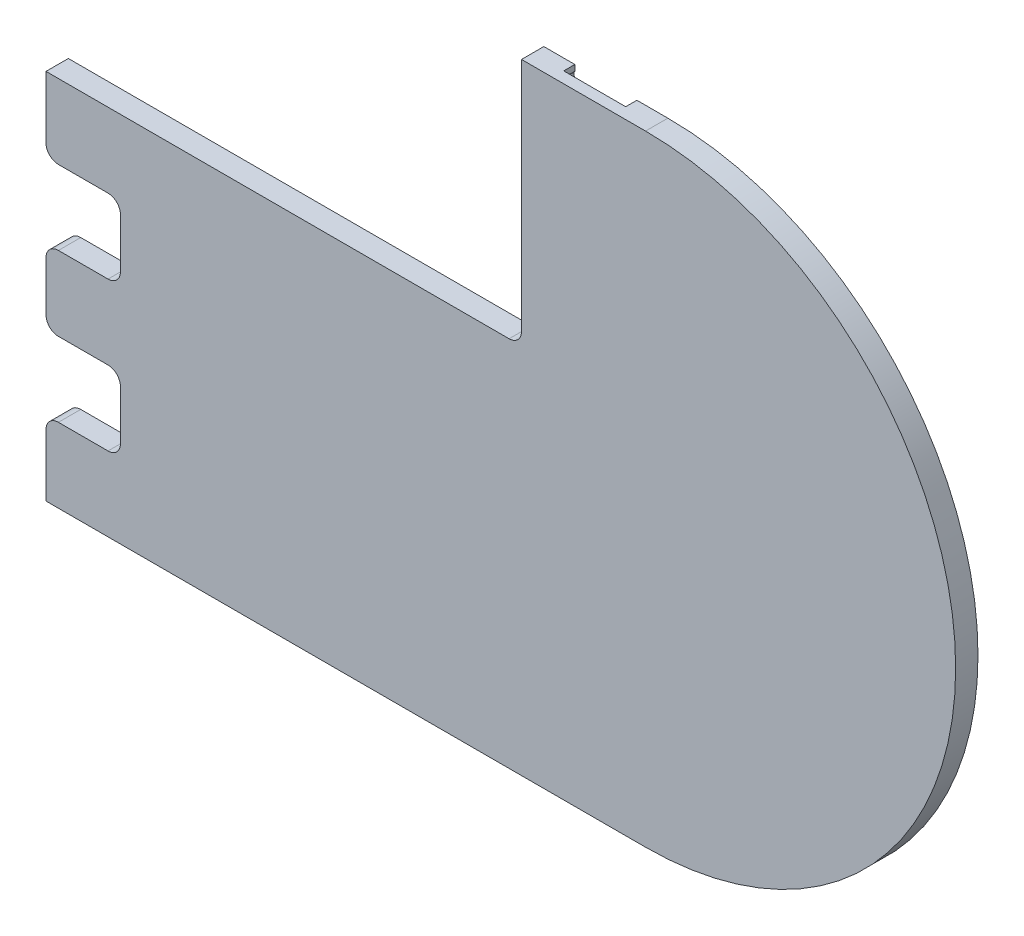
ISO-10303-21;
HEADER;
FILE_DESCRIPTION(('STEP AP214'),'2;1');
FILE_NAME('part.step','',(''),(''),'','','');
FILE_SCHEMA(('AUTOMOTIVE_DESIGN { 1 0 10303 214 1 1 1 1 }'));
ENDSEC;
DATA;
#1=APPLICATION_CONTEXT('core data for automotive mechanical design processes');
#2=APPLICATION_PROTOCOL_DEFINITION('international standard','automotive_design',2000,#1);
#3=PRODUCT_CONTEXT('',#1,'mechanical');
#4=PRODUCT('Part','Part','',(#3));
#5=PRODUCT_RELATED_PRODUCT_CATEGORY('part','',(#4));
#6=PRODUCT_DEFINITION_FORMATION('','',#4);
#7=PRODUCT_DEFINITION_CONTEXT('part definition',#1,'design');
#8=PRODUCT_DEFINITION('design','',#6,#7);
#9=PRODUCT_DEFINITION_SHAPE('','',#8);
#10=(LENGTH_UNIT() NAMED_UNIT(*) SI_UNIT(.MILLI.,.METRE.));
#11=(NAMED_UNIT(*) PLANE_ANGLE_UNIT() SI_UNIT($,.RADIAN.));
#12=(NAMED_UNIT(*) SI_UNIT($,.STERADIAN.) SOLID_ANGLE_UNIT());
#13=UNCERTAINTY_MEASURE_WITH_UNIT(LENGTH_MEASURE(1.E-05),#10,'distance_accuracy_value','');
#14=(GEOMETRIC_REPRESENTATION_CONTEXT(3) GLOBAL_UNCERTAINTY_ASSIGNED_CONTEXT((#13)) GLOBAL_UNIT_ASSIGNED_CONTEXT((#10,
#11,#12)) REPRESENTATION_CONTEXT('',''));
#15=CARTESIAN_POINT('',(0.,0.,0.));
#16=DIRECTION('',(0.,0.,1.));
#17=DIRECTION('',(1.,0.,0.));
#18=AXIS2_PLACEMENT_3D('',#15,#16,#17);
#19=CARTESIAN_POINT('',(403.545346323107,-210.12132034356,9.));
#20=DIRECTION('',(0.,0.,-1.));
#21=DIRECTION('',(-1.,0.,0.));
#22=AXIS2_PLACEMENT_3D('',#19,#20,#21);
#23=PLANE('',#22);
#24=CARTESIAN_POINT('',(403.545346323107,-210.12132034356,9.));
#25=DIRECTION('',(0.,0.,-1.));
#26=DIRECTION('',(-1.,0.,0.));
#27=AXIS2_PLACEMENT_3D('',#24,#25,#26);
#28=CIRCLE('',#27,3.);
#29=CARTESIAN_POINT('',(401.424025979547,-208.,9.));
#30=VERTEX_POINT('',#29);
#31=CARTESIAN_POINT('',(405.666666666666,-212.242640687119,9.));
#32=VERTEX_POINT('',#31);
#33=EDGE_CURVE('E777',#30,#32,#28,.T.);
#34=ORIENTED_EDGE('',*,*,#33,.T.);
#35=DIRECTION('',(0.,-1.,0.));
#36=VECTOR('',#35,1.);
#37=CARTESIAN_POINT('',(405.666666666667,-227.75735931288,9.));
#38=LINE('',#37,#36);
#39=CARTESIAN_POINT('',(405.666666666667,-227.75735931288,9.));
#40=VERTEX_POINT('',#39);
#41=EDGE_CURVE('E819',#32,#40,#38,.T.);
#42=ORIENTED_EDGE('',*,*,#41,.T.);
#43=CARTESIAN_POINT('',(403.545346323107,-229.87867965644,9.));
#44=DIRECTION('',(0.,0.,-1.));
#45=DIRECTION('',(1.,0.,0.));
#46=AXIS2_PLACEMENT_3D('',#43,#44,#45);
#47=CIRCLE('',#46,3.00000000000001);
#48=CARTESIAN_POINT('',(401.424025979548,-231.999999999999,9.));
#49=VERTEX_POINT('',#48);
#50=EDGE_CURVE('E813',#40,#49,#47,.T.);
#51=ORIENTED_EDGE('',*,*,#50,.T.);
#52=DIRECTION('',(-1.,0.,0.));
#53=VECTOR('',#52,1.);
#54=CARTESIAN_POINT('',(401.424025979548,-231.999999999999,9.));
#55=LINE('',#54,#53);
#56=CARTESIAN_POINT('',(391.909307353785,-231.999999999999,9.));
#57=VERTEX_POINT('',#56);
#58=EDGE_CURVE('E807',#49,#57,#55,.T.);
#59=ORIENTED_EDGE('',*,*,#58,.T.);
#60=CARTESIAN_POINT('',(389.787987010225,-229.87867965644,9.));
#61=DIRECTION('',(0.,0.,-1.));
#62=DIRECTION('',(-1.,0.,0.));
#63=AXIS2_PLACEMENT_3D('',#60,#61,#62);
#64=CIRCLE('',#63,3.00000000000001);
#65=CARTESIAN_POINT('',(387.666666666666,-227.75735931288,9.));
#66=VERTEX_POINT('',#65);
#67=EDGE_CURVE('E801',#57,#66,#64,.T.);
#68=ORIENTED_EDGE('',*,*,#67,.T.);
#69=DIRECTION('',(0.,1.,0.));
#70=VECTOR('',#69,1.);
#71=CARTESIAN_POINT('',(387.666666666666,-227.75735931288,9.));
#72=LINE('',#71,#70);
#73=CARTESIAN_POINT('',(387.666666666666,-212.242640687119,9.));
#74=VERTEX_POINT('',#73);
#75=EDGE_CURVE('E795',#66,#74,#72,.T.);
#76=ORIENTED_EDGE('',*,*,#75,.T.);
#77=CARTESIAN_POINT('',(389.787987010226,-210.12132034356,9.));
#78=DIRECTION('',(0.,0.,-1.));
#79=DIRECTION('',(1.,0.,0.));
#80=AXIS2_PLACEMENT_3D('',#77,#78,#79);
#81=CIRCLE('',#80,3.);
#82=CARTESIAN_POINT('',(391.909307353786,-208.,9.));
#83=VERTEX_POINT('',#82);
#84=EDGE_CURVE('E789',#74,#83,#81,.T.);
#85=ORIENTED_EDGE('',*,*,#84,.T.);
#86=DIRECTION('',(1.,0.,0.));
#87=VECTOR('',#86,1.);
#88=CARTESIAN_POINT('',(401.424025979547,-208.,9.));
#89=LINE('',#88,#87);
#90=EDGE_CURVE('E783',#83,#30,#89,.T.);
#91=ORIENTED_EDGE('',*,*,#90,.T.);
#92=EDGE_LOOP('',(#34,#42,#51,#59,#68,#76,#85,#91));
#93=FACE_BOUND('',#92,.T.);
#94=ADVANCED_FACE('F34',(#93),#23,.T.);
#95=CARTESIAN_POINT('',(405.666666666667,-227.75735931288,9.));
#96=DIRECTION('',(1.,0.,0.));
#97=DIRECTION('',(0.,1.,0.));
#98=AXIS2_PLACEMENT_3D('',#95,#96,#97);
#99=PLANE('',#98);
#100=DIRECTION('',(0.,-1.,0.));
#101=VECTOR('',#100,1.);
#102=CARTESIAN_POINT('',(405.666666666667,-227.75735931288,0.));
#103=LINE('',#102,#101);
#104=CARTESIAN_POINT('',(405.666666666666,-212.242640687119,0.));
#105=VERTEX_POINT('',#104);
#106=CARTESIAN_POINT('',(405.666666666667,-227.75735931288,0.));
#107=VERTEX_POINT('',#106);
#108=EDGE_CURVE('E771',#105,#107,#103,.T.);
#109=ORIENTED_EDGE('',*,*,#108,.T.);
#110=DIRECTION('',(0.,0.,-1.));
#111=VECTOR('',#110,1.);
#112=CARTESIAN_POINT('',(405.666666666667,-227.75735931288,9.));
#113=LINE('',#112,#111);
#114=EDGE_CURVE('E816',#40,#107,#113,.T.);
#115=ORIENTED_EDGE('',*,*,#114,.F.);
#116=ORIENTED_EDGE('',*,*,#41,.F.);
#117=DIRECTION('',(0.,0.,-1.));
#118=VECTOR('',#117,1.);
#119=CARTESIAN_POINT('',(405.666666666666,-212.242640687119,9.));
#120=LINE('',#119,#118);
#121=EDGE_CURVE('E774',#32,#105,#120,.T.);
#122=ORIENTED_EDGE('',*,*,#121,.T.);
#123=EDGE_LOOP('',(#109,#115,#116,#122));
#124=FACE_BOUND('',#123,.T.);
#125=ADVANCED_FACE('F975',(#124),#99,.F.);
#126=CARTESIAN_POINT('',(403.545346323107,-229.87867965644,9.));
#127=DIRECTION('',(0.,0.,-1.));
#128=DIRECTION('',(-1.,0.,0.));
#129=AXIS2_PLACEMENT_3D('',#126,#127,#128);
#130=CYLINDRICAL_SURFACE('',#129,3.00000000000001);
#131=CARTESIAN_POINT('',(403.545346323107,-229.87867965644,0.));
#132=DIRECTION('',(0.,0.,-1.));
#133=DIRECTION('',(1.,0.,0.));
#134=AXIS2_PLACEMENT_3D('',#131,#132,#133);
#135=CIRCLE('',#134,3.00000000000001);
#136=CARTESIAN_POINT('',(401.424025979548,-231.999999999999,0.));
#137=VERTEX_POINT('',#136);
#138=EDGE_CURVE('E768',#107,#137,#135,.T.);
#139=ORIENTED_EDGE('',*,*,#138,.T.);
#140=DIRECTION('',(0.,0.,-1.));
#141=VECTOR('',#140,1.);
#142=CARTESIAN_POINT('',(401.424025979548,-231.999999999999,9.));
#143=LINE('',#142,#141);
#144=EDGE_CURVE('E810',#49,#137,#143,.T.);
#145=ORIENTED_EDGE('',*,*,#144,.F.);
#146=ORIENTED_EDGE('',*,*,#50,.F.);
#147=ORIENTED_EDGE('',*,*,#114,.T.);
#148=EDGE_LOOP('',(#139,#145,#146,#147));
#149=FACE_BOUND('',#148,.T.);
#150=ADVANCED_FACE('F981',(#149),#130,.F.);
#151=CARTESIAN_POINT('',(401.424025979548,-231.999999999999,9.));
#152=DIRECTION('',(0.,-1.,0.));
#153=DIRECTION('',(0.,0.,-1.));
#154=AXIS2_PLACEMENT_3D('',#151,#152,#153);
#155=PLANE('',#154);
#156=DIRECTION('',(-1.,0.,0.));
#157=VECTOR('',#156,1.);
#158=CARTESIAN_POINT('',(401.424025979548,-231.999999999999,0.));
#159=LINE('',#158,#157);
#160=CARTESIAN_POINT('',(391.909307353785,-231.999999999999,0.));
#161=VERTEX_POINT('',#160);
#162=EDGE_CURVE('E765',#137,#161,#159,.T.);
#163=ORIENTED_EDGE('',*,*,#162,.T.);
#164=DIRECTION('',(0.,0.,-1.));
#165=VECTOR('',#164,1.);
#166=CARTESIAN_POINT('',(391.909307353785,-231.999999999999,9.));
#167=LINE('',#166,#165);
#168=EDGE_CURVE('E804',#57,#161,#167,.T.);
#169=ORIENTED_EDGE('',*,*,#168,.F.);
#170=ORIENTED_EDGE('',*,*,#58,.F.);
#171=ORIENTED_EDGE('',*,*,#144,.T.);
#172=EDGE_LOOP('',(#163,#169,#170,#171));
#173=FACE_BOUND('',#172,.T.);
#174=ADVANCED_FACE('F987',(#173),#155,.F.);
#175=CARTESIAN_POINT('',(389.787987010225,-229.87867965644,9.));
#176=DIRECTION('',(0.,0.,-1.));
#177=DIRECTION('',(-1.,0.,0.));
#178=AXIS2_PLACEMENT_3D('',#175,#176,#177);
#179=CYLINDRICAL_SURFACE('',#178,3.00000000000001);
#180=CARTESIAN_POINT('',(389.787987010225,-229.87867965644,0.));
#181=DIRECTION('',(0.,0.,-1.));
#182=DIRECTION('',(-1.,0.,0.));
#183=AXIS2_PLACEMENT_3D('',#180,#181,#182);
#184=CIRCLE('',#183,3.00000000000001);
#185=CARTESIAN_POINT('',(387.666666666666,-227.75735931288,0.));
#186=VERTEX_POINT('',#185);
#187=EDGE_CURVE('E762',#161,#186,#184,.T.);
#188=ORIENTED_EDGE('',*,*,#187,.T.);
#189=DIRECTION('',(0.,0.,-1.));
#190=VECTOR('',#189,1.);
#191=CARTESIAN_POINT('',(387.666666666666,-227.75735931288,9.));
#192=LINE('',#191,#190);
#193=EDGE_CURVE('E798',#66,#186,#192,.T.);
#194=ORIENTED_EDGE('',*,*,#193,.F.);
#195=ORIENTED_EDGE('',*,*,#67,.F.);
#196=ORIENTED_EDGE('',*,*,#168,.T.);
#197=EDGE_LOOP('',(#188,#194,#195,#196));
#198=FACE_BOUND('',#197,.T.);
#199=ADVANCED_FACE('F991',(#198),#179,.F.);
#200=CARTESIAN_POINT('',(387.666666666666,-227.75735931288,9.));
#201=DIRECTION('',(-1.,0.,0.));
#202=DIRECTION('',(0.,-1.,0.));
#203=AXIS2_PLACEMENT_3D('',#200,#201,#202);
#204=PLANE('',#203);
#205=DIRECTION('',(0.,1.,0.));
#206=VECTOR('',#205,1.);
#207=CARTESIAN_POINT('',(387.666666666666,-227.75735931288,0.));
#208=LINE('',#207,#206);
#209=CARTESIAN_POINT('',(387.666666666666,-212.242640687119,0.));
#210=VERTEX_POINT('',#209);
#211=EDGE_CURVE('E759',#186,#210,#208,.T.);
#212=ORIENTED_EDGE('',*,*,#211,.T.);
#213=DIRECTION('',(0.,0.,-1.));
#214=VECTOR('',#213,1.);
#215=CARTESIAN_POINT('',(387.666666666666,-212.242640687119,9.));
#216=LINE('',#215,#214);
#217=EDGE_CURVE('E792',#74,#210,#216,.T.);
#218=ORIENTED_EDGE('',*,*,#217,.F.);
#219=ORIENTED_EDGE('',*,*,#75,.F.);
#220=ORIENTED_EDGE('',*,*,#193,.T.);
#221=EDGE_LOOP('',(#212,#218,#219,#220));
#222=FACE_BOUND('',#221,.T.);
#223=ADVANCED_FACE('F995',(#222),#204,.F.);
#224=CARTESIAN_POINT('',(389.787987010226,-210.12132034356,9.));
#225=DIRECTION('',(0.,0.,-1.));
#226=DIRECTION('',(-1.,0.,0.));
#227=AXIS2_PLACEMENT_3D('',#224,#225,#226);
#228=CYLINDRICAL_SURFACE('',#227,3.);
#229=CARTESIAN_POINT('',(389.787987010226,-210.12132034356,0.));
#230=DIRECTION('',(0.,0.,-1.));
#231=DIRECTION('',(1.,0.,0.));
#232=AXIS2_PLACEMENT_3D('',#229,#230,#231);
#233=CIRCLE('',#232,3.);
#234=CARTESIAN_POINT('',(391.909307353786,-208.,0.));
#235=VERTEX_POINT('',#234);
#236=EDGE_CURVE('E756',#210,#235,#233,.T.);
#237=ORIENTED_EDGE('',*,*,#236,.T.);
#238=DIRECTION('',(0.,0.,-1.));
#239=VECTOR('',#238,1.);
#240=CARTESIAN_POINT('',(391.909307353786,-208.,9.));
#241=LINE('',#240,#239);
#242=EDGE_CURVE('E786',#83,#235,#241,.T.);
#243=ORIENTED_EDGE('',*,*,#242,.F.);
#244=ORIENTED_EDGE('',*,*,#84,.F.);
#245=ORIENTED_EDGE('',*,*,#217,.T.);
#246=EDGE_LOOP('',(#237,#243,#244,#245));
#247=FACE_BOUND('',#246,.T.);
#248=ADVANCED_FACE('F999',(#247),#228,.F.);
#249=CARTESIAN_POINT('',(401.424025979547,-208.,9.));
#250=DIRECTION('',(0.,1.,0.));
#251=DIRECTION('',(0.,0.,1.));
#252=AXIS2_PLACEMENT_3D('',#249,#250,#251);
#253=PLANE('',#252);
#254=DIRECTION('',(1.,0.,0.));
#255=VECTOR('',#254,1.);
#256=CARTESIAN_POINT('',(401.424025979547,-208.,0.));
#257=LINE('',#256,#255);
#258=CARTESIAN_POINT('',(401.424025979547,-208.,0.));
#259=VERTEX_POINT('',#258);
#260=EDGE_CURVE('E753',#235,#259,#257,.T.);
#261=ORIENTED_EDGE('',*,*,#260,.T.);
#262=DIRECTION('',(0.,0.,-1.));
#263=VECTOR('',#262,1.);
#264=CARTESIAN_POINT('',(401.424025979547,-208.,9.));
#265=LINE('',#264,#263);
#266=EDGE_CURVE('E780',#30,#259,#265,.T.);
#267=ORIENTED_EDGE('',*,*,#266,.F.);
#268=ORIENTED_EDGE('',*,*,#90,.F.);
#269=ORIENTED_EDGE('',*,*,#242,.T.);
#270=EDGE_LOOP('',(#261,#267,#268,#269));
#271=FACE_BOUND('',#270,.T.);
#272=ADVANCED_FACE('F1003',(#271),#253,.F.);
#273=CARTESIAN_POINT('',(403.545346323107,-210.12132034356,9.));
#274=DIRECTION('',(0.,0.,-1.));
#275=DIRECTION('',(-1.,0.,0.));
#276=AXIS2_PLACEMENT_3D('',#273,#274,#275);
#277=CYLINDRICAL_SURFACE('',#276,3.);
#278=CARTESIAN_POINT('',(403.545346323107,-210.12132034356,0.));
#279=DIRECTION('',(0.,0.,-1.));
#280=DIRECTION('',(-1.,0.,0.));
#281=AXIS2_PLACEMENT_3D('',#278,#279,#280);
#282=CIRCLE('',#281,3.);
#283=EDGE_CURVE('E751',#259,#105,#282,.T.);
#284=ORIENTED_EDGE('',*,*,#283,.T.);
#285=ORIENTED_EDGE('',*,*,#121,.F.);
#286=ORIENTED_EDGE('',*,*,#33,.F.);
#287=ORIENTED_EDGE('',*,*,#266,.T.);
#288=EDGE_LOOP('',(#284,#285,#286,#287));
#289=FACE_BOUND('',#288,.T.);
#290=ADVANCED_FACE('F1007',(#289),#277,.F.);
#291=CARTESIAN_POINT('',(-850.000000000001,250.,18.));
#292=DIRECTION('',(0.,-1.,0.));
#293=DIRECTION('',(0.,0.,-1.));
#294=AXIS2_PLACEMENT_3D('',#291,#292,#293);
#295=PLANE('',#294);
#296=DIRECTION('',(-1.,0.,0.));
#297=VECTOR('',#296,1.);
#298=CARTESIAN_POINT('',(-850.000000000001,250.,0.));
#299=LINE('',#298,#297);
#300=CARTESIAN_POINT('',(850.,250.,0.));
#301=VERTEX_POINT('',#300);
#302=CARTESIAN_POINT('',(825.,250.,0.));
#303=VERTEX_POINT('',#302);
#304=EDGE_CURVE('E666',#301,#303,#299,.T.);
#305=ORIENTED_EDGE('',*,*,#304,.T.);
#306=DIRECTION('',(0.,0.,1.));
#307=VECTOR('',#306,1.);
#308=CARTESIAN_POINT('',(825.,250.,18.));
#309=LINE('',#308,#307);
#310=CARTESIAN_POINT('',(825.,250.,9.));
#311=VERTEX_POINT('',#310);
#312=EDGE_CURVE('E459',#303,#311,#309,.T.);
#313=ORIENTED_EDGE('',*,*,#312,.T.);
#314=DIRECTION('',(1.,0.,0.));
#315=VECTOR('',#314,1.);
#316=CARTESIAN_POINT('',(-850.000000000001,250.,9.));
#317=LINE('',#316,#315);
#318=CARTESIAN_POINT('',(775.,250.,9.));
#319=VERTEX_POINT('',#318);
#320=EDGE_CURVE('E834',#319,#311,#317,.T.);
#321=ORIENTED_EDGE('',*,*,#320,.F.);
#322=DIRECTION('',(0.,0.,-1.));
#323=VECTOR('',#322,1.);
#324=CARTESIAN_POINT('',(775.,250.,18.));
#325=LINE('',#324,#323);
#326=CARTESIAN_POINT('',(775.,250.,0.));
#327=VERTEX_POINT('',#326);
#328=EDGE_CURVE('E451',#319,#327,#325,.T.);
#329=ORIENTED_EDGE('',*,*,#328,.T.);
#330=CARTESIAN_POINT('',(750.,250.,0.));
#331=VERTEX_POINT('',#330);
#332=EDGE_CURVE('E665',#327,#331,#299,.T.);
#333=ORIENTED_EDGE('',*,*,#332,.T.);
#334=DIRECTION('',(0.,0.,-1.));
#335=VECTOR('',#334,1.);
#336=CARTESIAN_POINT('',(750.,250.,2860.71829828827));
#337=LINE('',#336,#335);
#338=CARTESIAN_POINT('',(750.,250.,17.9999999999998));
#339=VERTEX_POINT('',#338);
#340=EDGE_CURVE('E643',#339,#331,#337,.T.);
#341=ORIENTED_EDGE('',*,*,#340,.F.);
#342=DIRECTION('',(-1.,0.,0.));
#343=VECTOR('',#342,1.);
#344=CARTESIAN_POINT('',(-850.000000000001,250.,18.));
#345=LINE('',#344,#343);
#346=CARTESIAN_POINT('',(850.,250.,18.));
#347=VERTEX_POINT('',#346);
#348=EDGE_CURVE('E656',#347,#339,#345,.T.);
#349=ORIENTED_EDGE('',*,*,#348,.F.);
#350=DIRECTION('',(0.,0.,-1.));
#351=VECTOR('',#350,1.);
#352=CARTESIAN_POINT('',(850.,250.,18.));
#353=LINE('',#352,#351);
#354=EDGE_CURVE('E674',#347,#301,#353,.T.);
#355=ORIENTED_EDGE('',*,*,#354,.T.);
#356=EDGE_LOOP('',(#305,#313,#321,#329,#333,#341,#349,#355));
#357=FACE_BOUND('',#356,.T.);
#358=ADVANCED_FACE('F938',(#357),#295,.F.);
#359=CARTESIAN_POINT('',(850.,-1.11022302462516E-13,18.));
#360=DIRECTION('',(0.,0.,1.));
#361=DIRECTION('',(1.,0.,0.));
#362=AXIS2_PLACEMENT_3D('',#359,#360,#361);
#363=PLANE('',#362);
#364=DIRECTION('',(1.,0.,0.));
#365=VECTOR('',#364,1.);
#366=CARTESIAN_POINT('',(850.,-190.,18.));
#367=LINE('',#366,#365);
#368=CARTESIAN_POINT('',(376.666666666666,-190.,18.));
#369=VERTEX_POINT('',#368);
#370=CARTESIAN_POINT('',(416.666666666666,-190.,18.));
#371=VERTEX_POINT('',#370);
#372=EDGE_CURVE('E632',#369,#371,#367,.T.);
#373=ORIENTED_EDGE('',*,*,#372,.F.);
#374=CARTESIAN_POINT('',(376.666666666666,-200.,18.));
#375=DIRECTION('',(0.,0.,1.));
#376=DIRECTION('',(1.,0.,0.));
#377=AXIS2_PLACEMENT_3D('',#374,#375,#376);
#378=CIRCLE('',#377,10.);
#379=CARTESIAN_POINT('',(366.666666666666,-200.,18.));
#380=VERTEX_POINT('',#379);
#381=EDGE_CURVE('E701',#369,#380,#378,.T.);
#382=ORIENTED_EDGE('',*,*,#381,.T.);
#383=DIRECTION('',(0.,1.,0.));
#384=VECTOR('',#383,1.);
#385=CARTESIAN_POINT('',(366.666666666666,-1.11022302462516E-13,18.));
#386=LINE('',#385,#384);
#387=CARTESIAN_POINT('',(366.666666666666,-250.,18.));
#388=VERTEX_POINT('',#387);
#389=EDGE_CURVE('E635',#388,#380,#386,.T.);
#390=ORIENTED_EDGE('',*,*,#389,.F.);
#391=DIRECTION('',(1.,0.,0.));
#392=VECTOR('',#391,1.);
#393=CARTESIAN_POINT('',(-850.000000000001,-250.,18.));
#394=LINE('',#393,#392);
#395=CARTESIAN_POINT('',(850.,-250.,18.));
#396=VERTEX_POINT('',#395);
#397=EDGE_CURVE('E660',#388,#396,#394,.T.);
#398=ORIENTED_EDGE('',*,*,#397,.T.);
#399=CARTESIAN_POINT('',(850.,-1.11022302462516E-13,18.));
#400=DIRECTION('',(0.,0.,1.));
#401=DIRECTION('',(1.,0.,0.));
#402=AXIS2_PLACEMENT_3D('',#399,#400,#401);
#403=CIRCLE('',#402,250.);
#404=EDGE_CURVE('E653',#396,#347,#403,.T.);
#405=ORIENTED_EDGE('',*,*,#404,.T.);
#406=ORIENTED_EDGE('',*,*,#348,.T.);
#407=DIRECTION('',(0.,1.,0.));
#408=VECTOR('',#407,1.);
#409=CARTESIAN_POINT('',(750.,49.9999999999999,17.9999999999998));
#410=LINE('',#409,#408);
#411=CARTESIAN_POINT('',(750.,59.9999999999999,17.9999999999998));
#412=VERTEX_POINT('',#411);
#413=EDGE_CURVE('E642',#412,#339,#410,.T.);
#414=ORIENTED_EDGE('',*,*,#413,.F.);
#415=CARTESIAN_POINT('',(740.,59.9999999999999,17.9999999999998));
#416=DIRECTION('',(0.,0.,1.));
#417=DIRECTION('',(1.,0.,0.));
#418=AXIS2_PLACEMENT_3D('',#415,#416,#417);
#419=CIRCLE('',#418,10.);
#420=CARTESIAN_POINT('',(740.,49.9999999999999,17.9999999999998));
#421=VERTEX_POINT('',#420);
#422=EDGE_CURVE('E829',#412,#421,#419,.F.);
#423=ORIENTED_EDGE('',*,*,#422,.T.);
#424=DIRECTION('',(1.,0.,0.));
#425=VECTOR('',#424,1.);
#426=CARTESIAN_POINT('',(-750.000000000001,49.9999999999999,17.9999999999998));
#427=LINE('',#426,#425);
#428=CARTESIAN_POINT('',(366.666666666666,49.9999999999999,17.9999999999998));
#429=VERTEX_POINT('',#428);
#430=EDGE_CURVE('E639',#429,#421,#427,.T.);
#431=ORIENTED_EDGE('',*,*,#430,.F.);
#432=DIRECTION('',(0.,1.,0.));
#433=VECTOR('',#432,1.);
#434=CARTESIAN_POINT('',(366.666666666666,-1.11022302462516E-13,18.));
#435=LINE('',#434,#433);
#436=CARTESIAN_POINT('',(366.666666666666,0.,18.));
#437=VERTEX_POINT('',#436);
#438=EDGE_CURVE('E612',#437,#429,#435,.T.);
#439=ORIENTED_EDGE('',*,*,#438,.F.);
#440=CARTESIAN_POINT('',(376.666666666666,0.,18.));
#441=DIRECTION('',(0.,0.,1.));
#442=DIRECTION('',(1.,0.,0.));
#443=AXIS2_PLACEMENT_3D('',#440,#441,#442);
#444=CIRCLE('',#443,10.);
#445=CARTESIAN_POINT('',(376.666666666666,-10.0000000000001,18.));
#446=VERTEX_POINT('',#445);
#447=EDGE_CURVE('E695',#437,#446,#444,.T.);
#448=ORIENTED_EDGE('',*,*,#447,.T.);
#449=DIRECTION('',(-1.,0.,0.));
#450=VECTOR('',#449,1.);
#451=CARTESIAN_POINT('',(850.,-10.0000000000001,18.));
#452=LINE('',#451,#450);
#453=CARTESIAN_POINT('',(416.666666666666,-10.0000000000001,18.));
#454=VERTEX_POINT('',#453);
#455=EDGE_CURVE('E614',#454,#446,#452,.T.);
#456=ORIENTED_EDGE('',*,*,#455,.F.);
#457=CARTESIAN_POINT('',(416.666666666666,-20.0000000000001,18.));
#458=DIRECTION('',(0.,0.,1.));
#459=DIRECTION('',(1.,0.,0.));
#460=AXIS2_PLACEMENT_3D('',#457,#458,#459);
#461=CIRCLE('',#460,10.);
#462=CARTESIAN_POINT('',(426.666666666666,-20.0000000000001,18.));
#463=VERTEX_POINT('',#462);
#464=EDGE_CURVE('E749',#454,#463,#461,.F.);
#465=ORIENTED_EDGE('',*,*,#464,.T.);
#466=DIRECTION('',(0.,1.,0.));
#467=VECTOR('',#466,1.);
#468=CARTESIAN_POINT('',(426.666666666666,-1.11022302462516E-13,18.));
#469=LINE('',#468,#467);
#470=CARTESIAN_POINT('',(426.666666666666,-60.0000000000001,18.));
#471=VERTEX_POINT('',#470);
#472=EDGE_CURVE('E617',#471,#463,#469,.T.);
#473=ORIENTED_EDGE('',*,*,#472,.F.);
#474=CARTESIAN_POINT('',(416.666666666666,-60.0000000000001,18.));
#475=DIRECTION('',(0.,0.,1.));
#476=DIRECTION('',(1.,0.,0.));
#477=AXIS2_PLACEMENT_3D('',#474,#475,#476);
#478=CIRCLE('',#477,10.);
#479=CARTESIAN_POINT('',(416.666666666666,-70.0000000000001,18.));
#480=VERTEX_POINT('',#479);
#481=EDGE_CURVE('E745',#471,#480,#478,.F.);
#482=ORIENTED_EDGE('',*,*,#481,.T.);
#483=DIRECTION('',(1.,0.,0.));
#484=VECTOR('',#483,1.);
#485=CARTESIAN_POINT('',(850.,-70.0000000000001,18.));
#486=LINE('',#485,#484);
#487=CARTESIAN_POINT('',(376.666666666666,-70.0000000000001,18.));
#488=VERTEX_POINT('',#487);
#489=EDGE_CURVE('E620',#488,#480,#486,.T.);
#490=ORIENTED_EDGE('',*,*,#489,.F.);
#491=CARTESIAN_POINT('',(376.666666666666,-80.0000000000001,18.));
#492=DIRECTION('',(0.,0.,1.));
#493=DIRECTION('',(1.,0.,0.));
#494=AXIS2_PLACEMENT_3D('',#491,#492,#493);
#495=CIRCLE('',#494,10.);
#496=CARTESIAN_POINT('',(366.666666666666,-80.0000000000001,18.));
#497=VERTEX_POINT('',#496);
#498=EDGE_CURVE('E697',#488,#497,#495,.T.);
#499=ORIENTED_EDGE('',*,*,#498,.T.);
#500=DIRECTION('',(0.,1.,0.));
#501=VECTOR('',#500,1.);
#502=CARTESIAN_POINT('',(366.666666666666,-1.11022302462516E-13,18.));
#503=LINE('',#502,#501);
#504=CARTESIAN_POINT('',(366.666666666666,-120.,18.));
#505=VERTEX_POINT('',#504);
#506=EDGE_CURVE('E623',#505,#497,#503,.T.);
#507=ORIENTED_EDGE('',*,*,#506,.F.);
#508=CARTESIAN_POINT('',(376.666666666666,-120.,18.));
#509=DIRECTION('',(0.,0.,1.));
#510=DIRECTION('',(1.,0.,0.));
#511=AXIS2_PLACEMENT_3D('',#508,#509,#510);
#512=CIRCLE('',#511,10.);
#513=CARTESIAN_POINT('',(376.666666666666,-130.,18.));
#514=VERTEX_POINT('',#513);
#515=EDGE_CURVE('E699',#505,#514,#512,.T.);
#516=ORIENTED_EDGE('',*,*,#515,.T.);
#517=DIRECTION('',(-1.,0.,0.));
#518=VECTOR('',#517,1.);
#519=CARTESIAN_POINT('',(850.,-130.,18.));
#520=LINE('',#519,#518);
#521=CARTESIAN_POINT('',(416.666666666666,-130.,18.));
#522=VERTEX_POINT('',#521);
#523=EDGE_CURVE('E626',#522,#514,#520,.T.);
#524=ORIENTED_EDGE('',*,*,#523,.F.);
#525=CARTESIAN_POINT('',(416.666666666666,-140.,18.));
#526=DIRECTION('',(0.,0.,1.));
#527=DIRECTION('',(1.,0.,0.));
#528=AXIS2_PLACEMENT_3D('',#525,#526,#527);
#529=CIRCLE('',#528,10.);
#530=CARTESIAN_POINT('',(426.666666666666,-140.,18.));
#531=VERTEX_POINT('',#530);
#532=EDGE_CURVE('E741',#522,#531,#529,.F.);
#533=ORIENTED_EDGE('',*,*,#532,.T.);
#534=DIRECTION('',(0.,1.,0.));
#535=VECTOR('',#534,1.);
#536=CARTESIAN_POINT('',(426.666666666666,-1.11022302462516E-13,18.));
#537=LINE('',#536,#535);
#538=CARTESIAN_POINT('',(426.666666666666,-180.,18.));
#539=VERTEX_POINT('',#538);
#540=EDGE_CURVE('E629',#539,#531,#537,.T.);
#541=ORIENTED_EDGE('',*,*,#540,.F.);
#542=CARTESIAN_POINT('',(416.666666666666,-180.,18.));
#543=DIRECTION('',(0.,0.,1.));
#544=DIRECTION('',(1.,0.,0.));
#545=AXIS2_PLACEMENT_3D('',#542,#543,#544);
#546=CIRCLE('',#545,10.);
#547=EDGE_CURVE('E737',#539,#371,#546,.F.);
#548=ORIENTED_EDGE('',*,*,#547,.T.);
#549=EDGE_LOOP('',(#373,#382,#390,#398,#405,#406,#414,#423,#431,#439,#448,#456,#465,#473,#482,
#490,#499,#507,#516,#524,#533,#541,#548));
#550=FACE_BOUND('',#549,.T.);
#551=ADVANCED_FACE('F851',(#550),#363,.T.);
#552=CARTESIAN_POINT('',(850.,-1.11022302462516E-13,18.));
#553=DIRECTION('',(0.,0.,-1.));
#554=DIRECTION('',(-1.,0.,0.));
#555=AXIS2_PLACEMENT_3D('',#552,#553,#554);
#556=CYLINDRICAL_SURFACE('',#555,250.);
#557=CARTESIAN_POINT('',(850.,-1.11022302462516E-13,0.));
#558=DIRECTION('',(0.,0.,1.));
#559=DIRECTION('',(1.,0.,0.));
#560=AXIS2_PLACEMENT_3D('',#557,#558,#559);
#561=CIRCLE('',#560,250.);
#562=CARTESIAN_POINT('',(850.,-250.,0.));
#563=VERTEX_POINT('',#562);
#564=EDGE_CURVE('E645',#563,#301,#561,.T.);
#565=ORIENTED_EDGE('',*,*,#564,.T.);
#566=ORIENTED_EDGE('',*,*,#354,.F.);
#567=ORIENTED_EDGE('',*,*,#404,.F.);
#568=DIRECTION('',(0.,0.,-1.));
#569=VECTOR('',#568,1.);
#570=CARTESIAN_POINT('',(850.,-250.,18.));
#571=LINE('',#570,#569);
#572=EDGE_CURVE('E662',#396,#563,#571,.T.);
#573=ORIENTED_EDGE('',*,*,#572,.T.);
#574=EDGE_LOOP('',(#565,#566,#567,#573));
#575=FACE_BOUND('',#574,.T.);
#576=ADVANCED_FACE('F942',(#575),#556,.T.);
#577=CARTESIAN_POINT('',(-850.000000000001,-250.,18.));
#578=DIRECTION('',(0.,1.,0.));
#579=DIRECTION('',(0.,0.,1.));
#580=AXIS2_PLACEMENT_3D('',#577,#578,#579);
#581=PLANE('',#580);
#582=DIRECTION('',(1.,0.,0.));
#583=VECTOR('',#582,1.);
#584=CARTESIAN_POINT('',(-850.000000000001,-250.,0.));
#585=LINE('',#584,#583);
#586=CARTESIAN_POINT('',(366.666666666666,-250.,0.));
#587=VERTEX_POINT('',#586);
#588=CARTESIAN_POINT('',(775.,-250.,0.));
#589=VERTEX_POINT('',#588);
#590=EDGE_CURVE('E657',#587,#589,#585,.T.);
#591=ORIENTED_EDGE('',*,*,#590,.T.);
#592=DIRECTION('',(0.,0.,1.));
#593=VECTOR('',#592,1.);
#594=CARTESIAN_POINT('',(774.999999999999,-250.,18.));
#595=LINE('',#594,#593);
#596=CARTESIAN_POINT('',(775.,-250.,9.));
#597=VERTEX_POINT('',#596);
#598=EDGE_CURVE('E423',#589,#597,#595,.T.);
#599=ORIENTED_EDGE('',*,*,#598,.T.);
#600=DIRECTION('',(-1.,0.,0.));
#601=VECTOR('',#600,1.);
#602=CARTESIAN_POINT('',(-850.000000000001,-250.,9.));
#603=LINE('',#602,#601);
#604=CARTESIAN_POINT('',(825.,-250.,9.));
#605=VERTEX_POINT('',#604);
#606=EDGE_CURVE('E11',#605,#597,#603,.T.);
#607=ORIENTED_EDGE('',*,*,#606,.F.);
#608=DIRECTION('',(0.,0.,-1.));
#609=VECTOR('',#608,1.);
#610=CARTESIAN_POINT('',(825.,-250.,18.));
#611=LINE('',#610,#609);
#612=CARTESIAN_POINT('',(825.,-250.,0.));
#613=VERTEX_POINT('',#612);
#614=EDGE_CURVE('E419',#605,#613,#611,.T.);
#615=ORIENTED_EDGE('',*,*,#614,.T.);
#616=EDGE_CURVE('E669',#613,#563,#585,.T.);
#617=ORIENTED_EDGE('',*,*,#616,.T.);
#618=ORIENTED_EDGE('',*,*,#572,.F.);
#619=ORIENTED_EDGE('',*,*,#397,.F.);
#620=DIRECTION('',(0.,0.,-1.));
#621=VECTOR('',#620,1.);
#622=CARTESIAN_POINT('',(366.666666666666,-250.,30.));
#623=LINE('',#622,#621);
#624=EDGE_CURVE('E609',#388,#587,#623,.T.);
#625=ORIENTED_EDGE('',*,*,#624,.T.);
#626=EDGE_LOOP('',(#591,#599,#607,#615,#617,#618,#619,#625));
#627=FACE_BOUND('',#626,.T.);
#628=ADVANCED_FACE('F842',(#627),#581,.F.);
#629=CARTESIAN_POINT('',(850.,-1.11022302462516E-13,0.));
#630=DIRECTION('',(0.,0.,1.));
#631=DIRECTION('',(1.,0.,0.));
#632=AXIS2_PLACEMENT_3D('',#629,#630,#631);
#633=PLANE('',#632);
#634=DIRECTION('',(0.,-1.,0.));
#635=VECTOR('',#634,1.);
#636=CARTESIAN_POINT('',(405.666666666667,-107.75735931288,0.));
#637=LINE('',#636,#635);
#638=CARTESIAN_POINT('',(405.666666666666,-92.2426406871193,0.));
#639=VERTEX_POINT('',#638);
#640=CARTESIAN_POINT('',(405.666666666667,-107.75735931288,0.));
#641=VERTEX_POINT('',#640);
#642=EDGE_CURVE('E462',#639,#641,#637,.T.);
#643=ORIENTED_EDGE('',*,*,#642,.F.);
#644=CARTESIAN_POINT('',(403.545346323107,-90.1213203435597,0.));
#645=DIRECTION('',(0.,0.,-1.));
#646=DIRECTION('',(-1.,0.,0.));
#647=AXIS2_PLACEMENT_3D('',#644,#645,#646);
#648=CIRCLE('',#647,3.);
#649=CARTESIAN_POINT('',(401.424025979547,-88.0000000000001,0.));
#650=VERTEX_POINT('',#649);
#651=EDGE_CURVE('E517',#650,#639,#648,.T.);
#652=ORIENTED_EDGE('',*,*,#651,.F.);
#653=DIRECTION('',(1.,0.,0.));
#654=VECTOR('',#653,1.);
#655=CARTESIAN_POINT('',(401.424025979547,-88.0000000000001,0.));
#656=LINE('',#655,#654);
#657=CARTESIAN_POINT('',(391.909307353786,-88.0000000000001,0.));
#658=VERTEX_POINT('',#657);
#659=EDGE_CURVE('E512',#658,#650,#656,.T.);
#660=ORIENTED_EDGE('',*,*,#659,.F.);
#661=CARTESIAN_POINT('',(389.787987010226,-90.1213203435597,0.));
#662=DIRECTION('',(0.,0.,-1.));
#663=DIRECTION('',(1.,0.,0.));
#664=AXIS2_PLACEMENT_3D('',#661,#662,#663);
#665=CIRCLE('',#664,3.);
#666=CARTESIAN_POINT('',(387.666666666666,-92.2426406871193,0.));
#667=VERTEX_POINT('',#666);
#668=EDGE_CURVE('E507',#667,#658,#665,.T.);
#669=ORIENTED_EDGE('',*,*,#668,.F.);
#670=DIRECTION('',(0.,1.,0.));
#671=VECTOR('',#670,1.);
#672=CARTESIAN_POINT('',(387.666666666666,-107.75735931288,0.));
#673=LINE('',#672,#671);
#674=CARTESIAN_POINT('',(387.666666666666,-107.75735931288,0.));
#675=VERTEX_POINT('',#674);
#676=EDGE_CURVE('E502',#675,#667,#673,.T.);
#677=ORIENTED_EDGE('',*,*,#676,.F.);
#678=CARTESIAN_POINT('',(389.787987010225,-109.87867965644,0.));
#679=DIRECTION('',(0.,0.,-1.));
#680=DIRECTION('',(-1.,0.,0.));
#681=AXIS2_PLACEMENT_3D('',#678,#679,#680);
#682=CIRCLE('',#681,3.00000000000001);
#683=CARTESIAN_POINT('',(391.909307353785,-111.999999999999,0.));
#684=VERTEX_POINT('',#683);
#685=EDGE_CURVE('E497',#684,#675,#682,.T.);
#686=ORIENTED_EDGE('',*,*,#685,.F.);
#687=DIRECTION('',(-1.,0.,0.));
#688=VECTOR('',#687,1.);
#689=CARTESIAN_POINT('',(401.424025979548,-111.999999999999,0.));
#690=LINE('',#689,#688);
#691=CARTESIAN_POINT('',(401.424025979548,-111.999999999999,0.));
#692=VERTEX_POINT('',#691);
#693=EDGE_CURVE('E492',#692,#684,#690,.T.);
#694=ORIENTED_EDGE('',*,*,#693,.F.);
#695=CARTESIAN_POINT('',(403.545346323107,-109.87867965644,0.));
#696=DIRECTION('',(0.,0.,-1.));
#697=DIRECTION('',(1.,0.,0.));
#698=AXIS2_PLACEMENT_3D('',#695,#696,#697);
#699=CIRCLE('',#698,3.00000000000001);
#700=EDGE_CURVE('E487',#641,#692,#699,.T.);
#701=ORIENTED_EDGE('',*,*,#700,.F.);
#702=EDGE_LOOP('',(#643,#652,#660,#669,#677,#686,#694,#701));
#703=FACE_BOUND('',#702,.T.);
#704=DIRECTION('',(0.,-1.,0.));
#705=VECTOR('',#704,1.);
#706=CARTESIAN_POINT('',(405.666666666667,12.2426406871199,0.));
#707=LINE('',#706,#705);
#708=CARTESIAN_POINT('',(405.666666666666,27.7573593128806,0.));
#709=VERTEX_POINT('',#708);
#710=CARTESIAN_POINT('',(405.666666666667,12.2426406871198,0.));
#711=VERTEX_POINT('',#710);
#712=EDGE_CURVE('E547',#709,#711,#707,.T.);
#713=ORIENTED_EDGE('',*,*,#712,.F.);
#714=CARTESIAN_POINT('',(403.545346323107,29.8786796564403,0.));
#715=DIRECTION('',(0.,0.,-1.));
#716=DIRECTION('',(-1.,0.,0.));
#717=AXIS2_PLACEMENT_3D('',#714,#715,#716);
#718=CIRCLE('',#717,3.);
#719=CARTESIAN_POINT('',(401.424025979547,31.9999999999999,0.));
#720=VERTEX_POINT('',#719);
#721=EDGE_CURVE('E519',#720,#709,#718,.T.);
#722=ORIENTED_EDGE('',*,*,#721,.F.);
#723=DIRECTION('',(1.,0.,0.));
#724=VECTOR('',#723,1.);
#725=CARTESIAN_POINT('',(401.424025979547,31.9999999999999,0.));
#726=LINE('',#725,#724);
#727=CARTESIAN_POINT('',(391.909307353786,31.9999999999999,0.));
#728=VERTEX_POINT('',#727);
#729=EDGE_CURVE('E524',#728,#720,#726,.T.);
#730=ORIENTED_EDGE('',*,*,#729,.F.);
#731=CARTESIAN_POINT('',(389.787987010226,29.8786796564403,0.));
#732=DIRECTION('',(0.,0.,-1.));
#733=DIRECTION('',(1.,0.,0.));
#734=AXIS2_PLACEMENT_3D('',#731,#732,#733);
#735=CIRCLE('',#734,3.);
#736=CARTESIAN_POINT('',(387.666666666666,27.7573593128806,0.));
#737=VERTEX_POINT('',#736);
#738=EDGE_CURVE('E562',#737,#728,#735,.T.);
#739=ORIENTED_EDGE('',*,*,#738,.F.);
#740=DIRECTION('',(0.,1.,0.));
#741=VECTOR('',#740,1.);
#742=CARTESIAN_POINT('',(387.666666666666,12.2426406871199,0.));
#743=LINE('',#742,#741);
#744=CARTESIAN_POINT('',(387.666666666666,12.2426406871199,0.));
#745=VERTEX_POINT('',#744);
#746=EDGE_CURVE('E559',#745,#737,#743,.T.);
#747=ORIENTED_EDGE('',*,*,#746,.F.);
#748=CARTESIAN_POINT('',(389.787987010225,10.1213203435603,0.));
#749=DIRECTION('',(0.,0.,-1.));
#750=DIRECTION('',(-1.,0.,0.));
#751=AXIS2_PLACEMENT_3D('',#748,#749,#750);
#752=CIRCLE('',#751,3.00000000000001);
#753=CARTESIAN_POINT('',(391.909307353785,8.00000000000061,0.));
#754=VERTEX_POINT('',#753);
#755=EDGE_CURVE('E556',#754,#745,#752,.T.);
#756=ORIENTED_EDGE('',*,*,#755,.F.);
#757=DIRECTION('',(-1.,0.,0.));
#758=VECTOR('',#757,1.);
#759=CARTESIAN_POINT('',(401.424025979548,8.00000000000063,0.));
#760=LINE('',#759,#758);
#761=CARTESIAN_POINT('',(401.424025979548,8.00000000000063,0.));
#762=VERTEX_POINT('',#761);
#763=EDGE_CURVE('E553',#762,#754,#760,.T.);
#764=ORIENTED_EDGE('',*,*,#763,.F.);
#765=CARTESIAN_POINT('',(403.545346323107,10.1213203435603,0.));
#766=DIRECTION('',(0.,0.,-1.));
#767=DIRECTION('',(1.,0.,0.));
#768=AXIS2_PLACEMENT_3D('',#765,#766,#767);
#769=CIRCLE('',#768,3.00000000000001);
#770=EDGE_CURVE('E550',#711,#762,#769,.T.);
#771=ORIENTED_EDGE('',*,*,#770,.F.);
#772=EDGE_LOOP('',(#713,#722,#730,#739,#747,#756,#764,#771));
#773=FACE_BOUND('',#772,.T.);
#774=DIRECTION('',(1.,0.,0.));
#775=VECTOR('',#774,1.);
#776=CARTESIAN_POINT('',(825.,-232.,0.));
#777=LINE('',#776,#775);
#778=CARTESIAN_POINT('',(775.,-232.,0.));
#779=VERTEX_POINT('',#778);
#780=CARTESIAN_POINT('',(825.,-232.,0.));
#781=VERTEX_POINT('',#780);
#782=EDGE_CURVE('E416',#779,#781,#777,.T.);
#783=ORIENTED_EDGE('',*,*,#782,.F.);
#784=DIRECTION('',(0.,-1.,0.));
#785=VECTOR('',#784,1.);
#786=CARTESIAN_POINT('',(775.,-1.11022302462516E-13,0.));
#787=LINE('',#786,#785);
#788=EDGE_CURVE('E42',#779,#589,#787,.T.);
#789=ORIENTED_EDGE('',*,*,#788,.T.);
#790=ORIENTED_EDGE('',*,*,#590,.F.);
#791=DIRECTION('',(0.,-1.,0.));
#792=VECTOR('',#791,1.);
#793=CARTESIAN_POINT('',(366.666666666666,0.,0.));
#794=LINE('',#793,#792);
#795=CARTESIAN_POINT('',(366.666666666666,-200.,0.));
#796=VERTEX_POINT('',#795);
#797=EDGE_CURVE('E607',#796,#587,#794,.T.);
#798=ORIENTED_EDGE('',*,*,#797,.F.);
#799=CARTESIAN_POINT('',(376.666666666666,-200.,0.));
#800=DIRECTION('',(0.,0.,1.));
#801=DIRECTION('',(1.,0.,0.));
#802=AXIS2_PLACEMENT_3D('',#799,#800,#801);
#803=CIRCLE('',#802,10.);
#804=CARTESIAN_POINT('',(376.666666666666,-190.,0.));
#805=VERTEX_POINT('',#804);
#806=EDGE_CURVE('E688',#796,#805,#803,.F.);
#807=ORIENTED_EDGE('',*,*,#806,.T.);
#808=DIRECTION('',(-1.,0.,0.));
#809=VECTOR('',#808,1.);
#810=CARTESIAN_POINT('',(0.,-190.,0.));
#811=LINE('',#810,#809);
#812=CARTESIAN_POINT('',(416.666666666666,-190.,0.));
#813=VERTEX_POINT('',#812);
#814=EDGE_CURVE('E604',#813,#805,#811,.T.);
#815=ORIENTED_EDGE('',*,*,#814,.F.);
#816=CARTESIAN_POINT('',(416.666666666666,-180.,0.));
#817=DIRECTION('',(0.,0.,1.));
#818=DIRECTION('',(1.,0.,0.));
#819=AXIS2_PLACEMENT_3D('',#816,#817,#818);
#820=CIRCLE('',#819,10.);
#821=CARTESIAN_POINT('',(426.666666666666,-180.,0.));
#822=VERTEX_POINT('',#821);
#823=EDGE_CURVE('E735',#813,#822,#820,.T.);
#824=ORIENTED_EDGE('',*,*,#823,.T.);
#825=DIRECTION('',(0.,-1.,0.));
#826=VECTOR('',#825,1.);
#827=CARTESIAN_POINT('',(426.666666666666,0.,0.));
#828=LINE('',#827,#826);
#829=CARTESIAN_POINT('',(426.666666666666,-140.,0.));
#830=VERTEX_POINT('',#829);
#831=EDGE_CURVE('E601',#830,#822,#828,.T.);
#832=ORIENTED_EDGE('',*,*,#831,.F.);
#833=CARTESIAN_POINT('',(416.666666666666,-140.,0.));
#834=DIRECTION('',(0.,0.,1.));
#835=DIRECTION('',(1.,0.,0.));
#836=AXIS2_PLACEMENT_3D('',#833,#834,#835);
#837=CIRCLE('',#836,10.);
#838=CARTESIAN_POINT('',(416.666666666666,-130.,0.));
#839=VERTEX_POINT('',#838);
#840=EDGE_CURVE('E739',#830,#839,#837,.T.);
#841=ORIENTED_EDGE('',*,*,#840,.T.);
#842=DIRECTION('',(1.,0.,0.));
#843=VECTOR('',#842,1.);
#844=CARTESIAN_POINT('',(0.,-130.,0.));
#845=LINE('',#844,#843);
#846=CARTESIAN_POINT('',(376.666666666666,-130.,0.));
#847=VERTEX_POINT('',#846);
#848=EDGE_CURVE('E598',#847,#839,#845,.T.);
#849=ORIENTED_EDGE('',*,*,#848,.F.);
#850=CARTESIAN_POINT('',(376.666666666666,-120.,0.));
#851=DIRECTION('',(0.,0.,1.));
#852=DIRECTION('',(1.,0.,0.));
#853=AXIS2_PLACEMENT_3D('',#850,#851,#852);
#854=CIRCLE('',#853,10.);
#855=CARTESIAN_POINT('',(366.666666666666,-120.,0.));
#856=VERTEX_POINT('',#855);
#857=EDGE_CURVE('E686',#847,#856,#854,.F.);
#858=ORIENTED_EDGE('',*,*,#857,.T.);
#859=DIRECTION('',(0.,-1.,0.));
#860=VECTOR('',#859,1.);
#861=CARTESIAN_POINT('',(366.666666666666,0.,0.));
#862=LINE('',#861,#860);
#863=CARTESIAN_POINT('',(366.666666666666,-80.0000000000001,0.));
#864=VERTEX_POINT('',#863);
#865=EDGE_CURVE('E595',#864,#856,#862,.T.);
#866=ORIENTED_EDGE('',*,*,#865,.F.);
#867=CARTESIAN_POINT('',(376.666666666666,-80.0000000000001,0.));
#868=DIRECTION('',(0.,0.,1.));
#869=DIRECTION('',(1.,0.,0.));
#870=AXIS2_PLACEMENT_3D('',#867,#868,#869);
#871=CIRCLE('',#870,10.);
#872=CARTESIAN_POINT('',(376.666666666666,-70.0000000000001,0.));
#873=VERTEX_POINT('',#872);
#874=EDGE_CURVE('E684',#864,#873,#871,.F.);
#875=ORIENTED_EDGE('',*,*,#874,.T.);
#876=DIRECTION('',(-1.,0.,0.));
#877=VECTOR('',#876,1.);
#878=CARTESIAN_POINT('',(0.,-70.0000000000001,0.));
#879=LINE('',#878,#877);
#880=CARTESIAN_POINT('',(416.666666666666,-70.0000000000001,0.));
#881=VERTEX_POINT('',#880);
#882=EDGE_CURVE('E592',#881,#873,#879,.T.);
#883=ORIENTED_EDGE('',*,*,#882,.F.);
#884=CARTESIAN_POINT('',(416.666666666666,-60.0000000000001,0.));
#885=DIRECTION('',(0.,0.,1.));
#886=DIRECTION('',(1.,0.,0.));
#887=AXIS2_PLACEMENT_3D('',#884,#885,#886);
#888=CIRCLE('',#887,10.);
#889=CARTESIAN_POINT('',(426.666666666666,-60.0000000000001,0.));
#890=VERTEX_POINT('',#889);
#891=EDGE_CURVE('E743',#881,#890,#888,.T.);
#892=ORIENTED_EDGE('',*,*,#891,.T.);
#893=DIRECTION('',(0.,-1.,0.));
#894=VECTOR('',#893,1.);
#895=CARTESIAN_POINT('',(426.666666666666,0.,0.));
#896=LINE('',#895,#894);
#897=CARTESIAN_POINT('',(426.666666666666,-20.0000000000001,0.));
#898=VERTEX_POINT('',#897);
#899=EDGE_CURVE('E589',#898,#890,#896,.T.);
#900=ORIENTED_EDGE('',*,*,#899,.F.);
#901=CARTESIAN_POINT('',(416.666666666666,-20.0000000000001,0.));
#902=DIRECTION('',(0.,0.,1.));
#903=DIRECTION('',(1.,0.,0.));
#904=AXIS2_PLACEMENT_3D('',#901,#902,#903);
#905=CIRCLE('',#904,10.);
#906=CARTESIAN_POINT('',(416.666666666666,-10.0000000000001,0.));
#907=VERTEX_POINT('',#906);
#908=EDGE_CURVE('E747',#898,#907,#905,.T.);
#909=ORIENTED_EDGE('',*,*,#908,.T.);
#910=DIRECTION('',(1.,0.,0.));
#911=VECTOR('',#910,1.);
#912=CARTESIAN_POINT('',(0.,-10.,0.));
#913=LINE('',#912,#911);
#914=CARTESIAN_POINT('',(376.666666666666,-10.0000000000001,0.));
#915=VERTEX_POINT('',#914);
#916=EDGE_CURVE('E586',#915,#907,#913,.T.);
#917=ORIENTED_EDGE('',*,*,#916,.F.);
#918=CARTESIAN_POINT('',(376.666666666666,0.,0.));
#919=DIRECTION('',(0.,0.,1.));
#920=DIRECTION('',(1.,0.,0.));
#921=AXIS2_PLACEMENT_3D('',#918,#919,#920);
#922=CIRCLE('',#921,10.);
#923=CARTESIAN_POINT('',(366.666666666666,0.,0.));
#924=VERTEX_POINT('',#923);
#925=EDGE_CURVE('E682',#915,#924,#922,.F.);
#926=ORIENTED_EDGE('',*,*,#925,.T.);
#927=DIRECTION('',(0.,-1.,0.));
#928=VECTOR('',#927,1.);
#929=CARTESIAN_POINT('',(366.666666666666,0.,0.));
#930=LINE('',#929,#928);
#931=CARTESIAN_POINT('',(366.666666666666,49.9999999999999,0.));
#932=VERTEX_POINT('',#931);
#933=EDGE_CURVE('E569',#932,#924,#930,.T.);
#934=ORIENTED_EDGE('',*,*,#933,.F.);
#935=DIRECTION('',(1.,0.,0.));
#936=VECTOR('',#935,1.);
#937=CARTESIAN_POINT('',(-750.000000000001,49.9999999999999,0.));
#938=LINE('',#937,#936);
#939=CARTESIAN_POINT('',(740.,49.9999999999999,0.));
#940=VERTEX_POINT('',#939);
#941=EDGE_CURVE('E648',#932,#940,#938,.T.);
#942=ORIENTED_EDGE('',*,*,#941,.T.);
#943=CARTESIAN_POINT('',(740.,59.9999999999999,0.));
#944=DIRECTION('',(0.,0.,1.));
#945=DIRECTION('',(1.,0.,0.));
#946=AXIS2_PLACEMENT_3D('',#943,#944,#945);
#947=CIRCLE('',#946,10.);
#948=CARTESIAN_POINT('',(750.,59.9999999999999,0.));
#949=VERTEX_POINT('',#948);
#950=EDGE_CURVE('E827',#940,#949,#947,.T.);
#951=ORIENTED_EDGE('',*,*,#950,.T.);
#952=DIRECTION('',(0.,1.,0.));
#953=VECTOR('',#952,1.);
#954=CARTESIAN_POINT('',(750.,49.9999999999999,0.));
#955=LINE('',#954,#953);
#956=EDGE_CURVE('E638',#949,#331,#955,.T.);
#957=ORIENTED_EDGE('',*,*,#956,.T.);
#958=ORIENTED_EDGE('',*,*,#332,.F.);
#959=DIRECTION('',(0.,1.,0.));
#960=VECTOR('',#959,1.);
#961=CARTESIAN_POINT('',(775.,259.,0.));
#962=LINE('',#961,#960);
#963=CARTESIAN_POINT('',(775.,245.242640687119,0.));
#964=VERTEX_POINT('',#963);
#965=EDGE_CURVE('E429',#964,#327,#962,.T.);
#966=ORIENTED_EDGE('',*,*,#965,.F.);
#967=CARTESIAN_POINT('',(777.121320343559,243.12132034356,0.));
#968=DIRECTION('',(0.,0.,-1.));
#969=DIRECTION('',(-1.,0.,0.));
#970=AXIS2_PLACEMENT_3D('',#967,#968,#969);
#971=CIRCLE('',#970,3.00000000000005);
#972=CARTESIAN_POINT('',(779.242640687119,241.,0.));
#973=VERTEX_POINT('',#972);
#974=EDGE_CURVE('E445',#973,#964,#971,.T.);
#975=ORIENTED_EDGE('',*,*,#974,.F.);
#976=DIRECTION('',(-1.,0.,0.));
#977=VECTOR('',#976,1.);
#978=CARTESIAN_POINT('',(820.75735931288,241.,0.));
#979=LINE('',#978,#977);
#980=CARTESIAN_POINT('',(820.75735931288,241.,0.));
#981=VERTEX_POINT('',#980);
#982=EDGE_CURVE('E442',#981,#973,#979,.T.);
#983=ORIENTED_EDGE('',*,*,#982,.F.);
#984=CARTESIAN_POINT('',(822.87867965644,243.12132034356,0.));
#985=DIRECTION('',(0.,0.,-1.));
#986=DIRECTION('',(-1.,0.,0.));
#987=AXIS2_PLACEMENT_3D('',#984,#985,#986);
#988=CIRCLE('',#987,3.00000000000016);
#989=CARTESIAN_POINT('',(825.,245.242640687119,0.));
#990=VERTEX_POINT('',#989);
#991=EDGE_CURVE('E425',#990,#981,#988,.T.);
#992=ORIENTED_EDGE('',*,*,#991,.F.);
#993=DIRECTION('',(0.,1.,0.));
#994=VECTOR('',#993,1.);
#995=CARTESIAN_POINT('',(825.,-1.11022302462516E-13,0.));
#996=LINE('',#995,#994);
#997=EDGE_CURVE('E831',#990,#303,#996,.T.);
#998=ORIENTED_EDGE('',*,*,#997,.T.);
#999=ORIENTED_EDGE('',*,*,#304,.F.);
#1000=ORIENTED_EDGE('',*,*,#564,.F.);
#1001=ORIENTED_EDGE('',*,*,#616,.F.);
#1002=DIRECTION('',(0.,-1.,0.));
#1003=VECTOR('',#1002,1.);
#1004=CARTESIAN_POINT('',(825.,-232.,0.));
#1005=LINE('',#1004,#1003);
#1006=EDGE_CURVE('E403',#781,#613,#1005,.T.);
#1007=ORIENTED_EDGE('',*,*,#1006,.F.);
#1008=EDGE_LOOP('',(#783,#789,#790,#798,#807,#815,#824,#832,#841,#849,#858,#866,#875,#883,#892,
#900,#909,#917,#926,#934,#942,#951,#957,#958,#966,#975,#983,#992,#998,#999,#1000,#1001,#1007));
#1009=FACE_BOUND('',#1008,.T.);
#1010=ORIENTED_EDGE('',*,*,#283,.F.);
#1011=ORIENTED_EDGE('',*,*,#260,.F.);
#1012=ORIENTED_EDGE('',*,*,#236,.F.);
#1013=ORIENTED_EDGE('',*,*,#211,.F.);
#1014=ORIENTED_EDGE('',*,*,#187,.F.);
#1015=ORIENTED_EDGE('',*,*,#162,.F.);
#1016=ORIENTED_EDGE('',*,*,#138,.F.);
#1017=ORIENTED_EDGE('',*,*,#108,.F.);
#1018=EDGE_LOOP('',(#1010,#1011,#1012,#1013,#1014,#1015,#1016,#1017));
#1019=FACE_BOUND('',#1018,.T.);
#1020=ADVANCED_FACE('F837',(#703,#773,#1009,#1019),#633,.F.);
#1021=CARTESIAN_POINT('',(-750.000000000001,49.9999999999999,2860.71829828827));
#1022=DIRECTION('',(0.,1.,0.));
#1023=DIRECTION('',(0.,0.,1.));
#1024=AXIS2_PLACEMENT_3D('',#1021,#1022,#1023);
#1025=PLANE('',#1024);
#1026=ORIENTED_EDGE('',*,*,#430,.T.);
#1027=DIRECTION('',(0.,0.,-1.));
#1028=VECTOR('',#1027,1.);
#1029=CARTESIAN_POINT('',(740.,49.9999999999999,0.));
#1030=LINE('',#1029,#1028);
#1031=EDGE_CURVE('E822',#421,#940,#1030,.T.);
#1032=ORIENTED_EDGE('',*,*,#1031,.T.);
#1033=ORIENTED_EDGE('',*,*,#941,.F.);
#1034=DIRECTION('',(0.,0.,-1.));
#1035=VECTOR('',#1034,1.);
#1036=CARTESIAN_POINT('',(366.666666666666,49.9999999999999,2860.71829828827));
#1037=LINE('',#1036,#1035);
#1038=EDGE_CURVE('E677',#429,#932,#1037,.T.);
#1039=ORIENTED_EDGE('',*,*,#1038,.F.);
#1040=EDGE_LOOP('',(#1026,#1032,#1033,#1039));
#1041=FACE_BOUND('',#1040,.T.);
#1042=ADVANCED_FACE('F926',(#1041),#1025,.T.);
#1043=CARTESIAN_POINT('',(750.,49.9999999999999,2860.71829828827));
#1044=DIRECTION('',(-1.,0.,0.));
#1045=DIRECTION('',(0.,0.,1.));
#1046=AXIS2_PLACEMENT_3D('',#1043,#1044,#1045);
#1047=PLANE('',#1046);
#1048=ORIENTED_EDGE('',*,*,#956,.F.);
#1049=DIRECTION('',(0.,0.,-1.));
#1050=VECTOR('',#1049,1.);
#1051=CARTESIAN_POINT('',(750.,59.9999999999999,17.9999999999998));
#1052=LINE('',#1051,#1050);
#1053=EDGE_CURVE('E825',#949,#412,#1052,.F.);
#1054=ORIENTED_EDGE('',*,*,#1053,.T.);
#1055=ORIENTED_EDGE('',*,*,#413,.T.);
#1056=ORIENTED_EDGE('',*,*,#340,.T.);
#1057=EDGE_LOOP('',(#1048,#1054,#1055,#1056));
#1058=FACE_BOUND('',#1057,.T.);
#1059=ADVANCED_FACE('F935',(#1058),#1047,.T.);
#1060=CARTESIAN_POINT('',(366.666666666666,0.,30.));
#1061=DIRECTION('',(1.,0.,0.));
#1062=DIRECTION('',(0.,0.,-1.));
#1063=AXIS2_PLACEMENT_3D('',#1060,#1061,#1062);
#1064=PLANE('',#1063);
#1065=ORIENTED_EDGE('',*,*,#389,.T.);
#1066=DIRECTION('',(0.,0.,-1.));
#1067=VECTOR('',#1066,1.);
#1068=CARTESIAN_POINT('',(366.666666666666,-200.,30.));
#1069=LINE('',#1068,#1067);
#1070=EDGE_CURVE('E679',#380,#796,#1069,.T.);
#1071=ORIENTED_EDGE('',*,*,#1070,.T.);
#1072=ORIENTED_EDGE('',*,*,#797,.T.);
#1073=ORIENTED_EDGE('',*,*,#624,.F.);
#1074=EDGE_LOOP('',(#1065,#1071,#1072,#1073));
#1075=FACE_BOUND('',#1074,.T.);
#1076=ADVANCED_FACE('F847',(#1075),#1064,.F.);
#1077=CARTESIAN_POINT('',(0.,-190.,30.));
#1078=DIRECTION('',(0.,-1.,0.));
#1079=DIRECTION('',(0.,0.,-1.));
#1080=AXIS2_PLACEMENT_3D('',#1077,#1078,#1079);
#1081=PLANE('',#1080);
#1082=ORIENTED_EDGE('',*,*,#814,.T.);
#1083=DIRECTION('',(0.,0.,-1.));
#1084=VECTOR('',#1083,1.);
#1085=CARTESIAN_POINT('',(376.666666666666,-190.,30.));
#1086=LINE('',#1085,#1084);
#1087=EDGE_CURVE('E693',#805,#369,#1086,.F.);
#1088=ORIENTED_EDGE('',*,*,#1087,.T.);
#1089=ORIENTED_EDGE('',*,*,#372,.T.);
#1090=DIRECTION('',(0.,0.,-1.));
#1091=VECTOR('',#1090,1.);
#1092=CARTESIAN_POINT('',(416.666666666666,-190.,0.));
#1093=LINE('',#1092,#1091);
#1094=EDGE_CURVE('E690',#371,#813,#1093,.T.);
#1095=ORIENTED_EDGE('',*,*,#1094,.T.);
#1096=EDGE_LOOP('',(#1082,#1088,#1089,#1095));
#1097=FACE_BOUND('',#1096,.T.);
#1098=ADVANCED_FACE('F858',(#1097),#1081,.F.);
#1099=CARTESIAN_POINT('',(426.666666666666,0.,30.));
#1100=DIRECTION('',(1.,0.,0.));
#1101=DIRECTION('',(0.,0.,-1.));
#1102=AXIS2_PLACEMENT_3D('',#1099,#1100,#1101);
#1103=PLANE('',#1102);
#1104=ORIENTED_EDGE('',*,*,#831,.T.);
#1105=DIRECTION('',(0.,0.,-1.));
#1106=VECTOR('',#1105,1.);
#1107=CARTESIAN_POINT('',(426.666666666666,-180.,18.));
#1108=LINE('',#1107,#1106);
#1109=EDGE_CURVE('E706',#822,#539,#1108,.F.);
#1110=ORIENTED_EDGE('',*,*,#1109,.T.);
#1111=ORIENTED_EDGE('',*,*,#540,.T.);
#1112=DIRECTION('',(0.,0.,-1.));
#1113=VECTOR('',#1112,1.);
#1114=CARTESIAN_POINT('',(426.666666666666,-140.,0.));
#1115=LINE('',#1114,#1113);
#1116=EDGE_CURVE('E703',#531,#830,#1115,.T.);
#1117=ORIENTED_EDGE('',*,*,#1116,.T.);
#1118=EDGE_LOOP('',(#1104,#1110,#1111,#1117));
#1119=FACE_BOUND('',#1118,.T.);
#1120=ADVANCED_FACE('F866',(#1119),#1103,.F.);
#1121=CARTESIAN_POINT('',(0.,-130.,30.));
#1122=DIRECTION('',(0.,1.,0.));
#1123=DIRECTION('',(-1.,0.,0.));
#1124=AXIS2_PLACEMENT_3D('',#1121,#1122,#1123);
#1125=PLANE('',#1124);
#1126=ORIENTED_EDGE('',*,*,#523,.T.);
#1127=DIRECTION('',(0.,0.,-1.));
#1128=VECTOR('',#1127,1.);
#1129=CARTESIAN_POINT('',(376.666666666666,-130.,30.));
#1130=LINE('',#1129,#1128);
#1131=EDGE_CURVE('E710',#514,#847,#1130,.T.);
#1132=ORIENTED_EDGE('',*,*,#1131,.T.);
#1133=ORIENTED_EDGE('',*,*,#848,.T.);
#1134=DIRECTION('',(0.,0.,-1.));
#1135=VECTOR('',#1134,1.);
#1136=CARTESIAN_POINT('',(416.666666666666,-130.,18.));
#1137=LINE('',#1136,#1135);
#1138=EDGE_CURVE('E708',#839,#522,#1137,.F.);
#1139=ORIENTED_EDGE('',*,*,#1138,.T.);
#1140=EDGE_LOOP('',(#1126,#1132,#1133,#1139));
#1141=FACE_BOUND('',#1140,.T.);
#1142=ADVANCED_FACE('F875',(#1141),#1125,.F.);
#1143=CARTESIAN_POINT('',(366.666666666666,0.,30.));
#1144=DIRECTION('',(1.,0.,0.));
#1145=DIRECTION('',(0.,0.,-1.));
#1146=AXIS2_PLACEMENT_3D('',#1143,#1144,#1145);
#1147=PLANE('',#1146);
#1148=ORIENTED_EDGE('',*,*,#865,.T.);
#1149=DIRECTION('',(0.,0.,-1.));
#1150=VECTOR('',#1149,1.);
#1151=CARTESIAN_POINT('',(366.666666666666,-120.,30.));
#1152=LINE('',#1151,#1150);
#1153=EDGE_CURVE('E716',#856,#505,#1152,.F.);
#1154=ORIENTED_EDGE('',*,*,#1153,.T.);
#1155=ORIENTED_EDGE('',*,*,#506,.T.);
#1156=DIRECTION('',(0.,0.,-1.));
#1157=VECTOR('',#1156,1.);
#1158=CARTESIAN_POINT('',(366.666666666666,-80.0000000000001,30.));
#1159=LINE('',#1158,#1157);
#1160=EDGE_CURVE('E713',#497,#864,#1159,.T.);
#1161=ORIENTED_EDGE('',*,*,#1160,.T.);
#1162=EDGE_LOOP('',(#1148,#1154,#1155,#1161));
#1163=FACE_BOUND('',#1162,.T.);
#1164=ADVANCED_FACE('F884',(#1163),#1147,.F.);
#1165=CARTESIAN_POINT('',(0.,-70.0000000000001,30.));
#1166=DIRECTION('',(0.,-1.,0.));
#1167=DIRECTION('',(0.,0.,-1.));
#1168=AXIS2_PLACEMENT_3D('',#1165,#1166,#1167);
#1169=PLANE('',#1168);
#1170=ORIENTED_EDGE('',*,*,#489,.T.);
#1171=DIRECTION('',(0.,0.,-1.));
#1172=VECTOR('',#1171,1.);
#1173=CARTESIAN_POINT('',(416.666666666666,-70.0000000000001,0.));
#1174=LINE('',#1173,#1172);
#1175=EDGE_CURVE('E720',#480,#881,#1174,.T.);
#1176=ORIENTED_EDGE('',*,*,#1175,.T.);
#1177=ORIENTED_EDGE('',*,*,#882,.T.);
#1178=DIRECTION('',(0.,0.,-1.));
#1179=VECTOR('',#1178,1.);
#1180=CARTESIAN_POINT('',(376.666666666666,-70.0000000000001,30.));
#1181=LINE('',#1180,#1179);
#1182=EDGE_CURVE('E718',#873,#488,#1181,.F.);
#1183=ORIENTED_EDGE('',*,*,#1182,.T.);
#1184=EDGE_LOOP('',(#1170,#1176,#1177,#1183));
#1185=FACE_BOUND('',#1184,.T.);
#1186=ADVANCED_FACE('F893',(#1185),#1169,.F.);
#1187=CARTESIAN_POINT('',(426.666666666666,0.,30.));
#1188=DIRECTION('',(1.,0.,0.));
#1189=DIRECTION('',(0.,0.,-1.));
#1190=AXIS2_PLACEMENT_3D('',#1187,#1188,#1189);
#1191=PLANE('',#1190);
#1192=ORIENTED_EDGE('',*,*,#899,.T.);
#1193=DIRECTION('',(0.,0.,-1.));
#1194=VECTOR('',#1193,1.);
#1195=CARTESIAN_POINT('',(426.666666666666,-60.0000000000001,18.));
#1196=LINE('',#1195,#1194);
#1197=EDGE_CURVE('E726',#890,#471,#1196,.F.);
#1198=ORIENTED_EDGE('',*,*,#1197,.T.);
#1199=ORIENTED_EDGE('',*,*,#472,.T.);
#1200=DIRECTION('',(0.,0.,-1.));
#1201=VECTOR('',#1200,1.);
#1202=CARTESIAN_POINT('',(426.666666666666,-20.0000000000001,0.));
#1203=LINE('',#1202,#1201);
#1204=EDGE_CURVE('E723',#463,#898,#1203,.T.);
#1205=ORIENTED_EDGE('',*,*,#1204,.T.);
#1206=EDGE_LOOP('',(#1192,#1198,#1199,#1205));
#1207=FACE_BOUND('',#1206,.T.);
#1208=ADVANCED_FACE('F902',(#1207),#1191,.F.);
#1209=CARTESIAN_POINT('',(0.,-10.,30.));
#1210=DIRECTION('',(0.,1.,0.));
#1211=DIRECTION('',(-1.,0.,0.));
#1212=AXIS2_PLACEMENT_3D('',#1209,#1210,#1211);
#1213=PLANE('',#1212);
#1214=ORIENTED_EDGE('',*,*,#455,.T.);
#1215=DIRECTION('',(0.,0.,-1.));
#1216=VECTOR('',#1215,1.);
#1217=CARTESIAN_POINT('',(376.666666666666,-10.0000000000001,30.));
#1218=LINE('',#1217,#1216);
#1219=EDGE_CURVE('E730',#446,#915,#1218,.T.);
#1220=ORIENTED_EDGE('',*,*,#1219,.T.);
#1221=ORIENTED_EDGE('',*,*,#916,.T.);
#1222=DIRECTION('',(0.,0.,-1.));
#1223=VECTOR('',#1222,1.);
#1224=CARTESIAN_POINT('',(416.666666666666,-10.0000000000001,18.));
#1225=LINE('',#1224,#1223);
#1226=EDGE_CURVE('E728',#907,#454,#1225,.F.);
#1227=ORIENTED_EDGE('',*,*,#1226,.T.);
#1228=EDGE_LOOP('',(#1214,#1220,#1221,#1227));
#1229=FACE_BOUND('',#1228,.T.);
#1230=ADVANCED_FACE('F911',(#1229),#1213,.F.);
#1231=CARTESIAN_POINT('',(366.666666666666,0.,30.));
#1232=DIRECTION('',(1.,0.,0.));
#1233=DIRECTION('',(0.,0.,-1.));
#1234=AXIS2_PLACEMENT_3D('',#1231,#1232,#1233);
#1235=PLANE('',#1234);
#1236=ORIENTED_EDGE('',*,*,#933,.T.);
#1237=DIRECTION('',(0.,0.,-1.));
#1238=VECTOR('',#1237,1.);
#1239=CARTESIAN_POINT('',(366.666666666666,0.,30.));
#1240=LINE('',#1239,#1238);
#1241=EDGE_CURVE('E733',#924,#437,#1240,.F.);
#1242=ORIENTED_EDGE('',*,*,#1241,.T.);
#1243=ORIENTED_EDGE('',*,*,#438,.T.);
#1244=ORIENTED_EDGE('',*,*,#1038,.T.);
#1245=EDGE_LOOP('',(#1236,#1242,#1243,#1244));
#1246=FACE_BOUND('',#1245,.T.);
#1247=ADVANCED_FACE('F921',(#1246),#1235,.F.);
#1248=CARTESIAN_POINT('',(376.666666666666,-200.,30.));
#1249=DIRECTION('',(0.,0.,-1.));
#1250=DIRECTION('',(-1.,0.,0.));
#1251=AXIS2_PLACEMENT_3D('',#1248,#1249,#1250);
#1252=CYLINDRICAL_SURFACE('',#1251,10.);
#1253=ORIENTED_EDGE('',*,*,#381,.F.);
#1254=ORIENTED_EDGE('',*,*,#1087,.F.);
#1255=ORIENTED_EDGE('',*,*,#806,.F.);
#1256=ORIENTED_EDGE('',*,*,#1070,.F.);
#1257=EDGE_LOOP('',(#1253,#1254,#1255,#1256));
#1258=FACE_BOUND('',#1257,.T.);
#1259=ADVANCED_FACE('F855',(#1258),#1252,.T.);
#1260=CARTESIAN_POINT('',(416.666666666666,-180.,30.));
#1261=DIRECTION('',(0.,0.,1.));
#1262=DIRECTION('',(1.,0.,0.));
#1263=AXIS2_PLACEMENT_3D('',#1260,#1261,#1262);
#1264=CYLINDRICAL_SURFACE('',#1263,10.);
#1265=ORIENTED_EDGE('',*,*,#547,.F.);
#1266=ORIENTED_EDGE('',*,*,#1109,.F.);
#1267=ORIENTED_EDGE('',*,*,#823,.F.);
#1268=ORIENTED_EDGE('',*,*,#1094,.F.);
#1269=EDGE_LOOP('',(#1265,#1266,#1267,#1268));
#1270=FACE_BOUND('',#1269,.T.);
#1271=ADVANCED_FACE('F862',(#1270),#1264,.F.);
#1272=CARTESIAN_POINT('',(376.666666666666,-120.,30.));
#1273=DIRECTION('',(0.,0.,-1.));
#1274=DIRECTION('',(-1.,0.,0.));
#1275=AXIS2_PLACEMENT_3D('',#1272,#1273,#1274);
#1276=CYLINDRICAL_SURFACE('',#1275,10.);
#1277=ORIENTED_EDGE('',*,*,#515,.F.);
#1278=ORIENTED_EDGE('',*,*,#1153,.F.);
#1279=ORIENTED_EDGE('',*,*,#857,.F.);
#1280=ORIENTED_EDGE('',*,*,#1131,.F.);
#1281=EDGE_LOOP('',(#1277,#1278,#1279,#1280));
#1282=FACE_BOUND('',#1281,.T.);
#1283=ADVANCED_FACE('F880',(#1282),#1276,.T.);
#1284=CARTESIAN_POINT('',(416.666666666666,-140.,30.));
#1285=DIRECTION('',(0.,0.,1.));
#1286=DIRECTION('',(1.,0.,0.));
#1287=AXIS2_PLACEMENT_3D('',#1284,#1285,#1286);
#1288=CYLINDRICAL_SURFACE('',#1287,10.);
#1289=ORIENTED_EDGE('',*,*,#532,.F.);
#1290=ORIENTED_EDGE('',*,*,#1138,.F.);
#1291=ORIENTED_EDGE('',*,*,#840,.F.);
#1292=ORIENTED_EDGE('',*,*,#1116,.F.);
#1293=EDGE_LOOP('',(#1289,#1290,#1291,#1292));
#1294=FACE_BOUND('',#1293,.T.);
#1295=ADVANCED_FACE('F871',(#1294),#1288,.F.);
#1296=CARTESIAN_POINT('',(416.666666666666,-60.0000000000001,30.));
#1297=DIRECTION('',(0.,0.,1.));
#1298=DIRECTION('',(1.,0.,0.));
#1299=AXIS2_PLACEMENT_3D('',#1296,#1297,#1298);
#1300=CYLINDRICAL_SURFACE('',#1299,10.);
#1301=ORIENTED_EDGE('',*,*,#481,.F.);
#1302=ORIENTED_EDGE('',*,*,#1197,.F.);
#1303=ORIENTED_EDGE('',*,*,#891,.F.);
#1304=ORIENTED_EDGE('',*,*,#1175,.F.);
#1305=EDGE_LOOP('',(#1301,#1302,#1303,#1304));
#1306=FACE_BOUND('',#1305,.T.);
#1307=ADVANCED_FACE('F898',(#1306),#1300,.F.);
#1308=CARTESIAN_POINT('',(376.666666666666,-80.0000000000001,30.));
#1309=DIRECTION('',(0.,0.,-1.));
#1310=DIRECTION('',(-1.,0.,0.));
#1311=AXIS2_PLACEMENT_3D('',#1308,#1309,#1310);
#1312=CYLINDRICAL_SURFACE('',#1311,10.);
#1313=ORIENTED_EDGE('',*,*,#498,.F.);
#1314=ORIENTED_EDGE('',*,*,#1182,.F.);
#1315=ORIENTED_EDGE('',*,*,#874,.F.);
#1316=ORIENTED_EDGE('',*,*,#1160,.F.);
#1317=EDGE_LOOP('',(#1313,#1314,#1315,#1316));
#1318=FACE_BOUND('',#1317,.T.);
#1319=ADVANCED_FACE('F889',(#1318),#1312,.T.);
#1320=CARTESIAN_POINT('',(376.666666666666,0.,30.));
#1321=DIRECTION('',(0.,0.,-1.));
#1322=DIRECTION('',(-1.,0.,0.));
#1323=AXIS2_PLACEMENT_3D('',#1320,#1321,#1322);
#1324=CYLINDRICAL_SURFACE('',#1323,10.);
#1325=ORIENTED_EDGE('',*,*,#447,.F.);
#1326=ORIENTED_EDGE('',*,*,#1241,.F.);
#1327=ORIENTED_EDGE('',*,*,#925,.F.);
#1328=ORIENTED_EDGE('',*,*,#1219,.F.);
#1329=EDGE_LOOP('',(#1325,#1326,#1327,#1328));
#1330=FACE_BOUND('',#1329,.T.);
#1331=ADVANCED_FACE('F916',(#1330),#1324,.T.);
#1332=CARTESIAN_POINT('',(416.666666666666,-20.0000000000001,30.));
#1333=DIRECTION('',(0.,0.,1.));
#1334=DIRECTION('',(1.,0.,0.));
#1335=AXIS2_PLACEMENT_3D('',#1332,#1333,#1334);
#1336=CYLINDRICAL_SURFACE('',#1335,10.);
#1337=ORIENTED_EDGE('',*,*,#464,.F.);
#1338=ORIENTED_EDGE('',*,*,#1226,.F.);
#1339=ORIENTED_EDGE('',*,*,#908,.F.);
#1340=ORIENTED_EDGE('',*,*,#1204,.F.);
#1341=EDGE_LOOP('',(#1337,#1338,#1339,#1340));
#1342=FACE_BOUND('',#1341,.T.);
#1343=ADVANCED_FACE('F907',(#1342),#1336,.F.);
#1344=CARTESIAN_POINT('',(403.545346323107,29.8786796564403,9.));
#1345=DIRECTION('',(0.,0.,-1.));
#1346=DIRECTION('',(-1.,0.,0.));
#1347=AXIS2_PLACEMENT_3D('',#1344,#1345,#1346);
#1348=CYLINDRICAL_SURFACE('',#1347,3.);
#1349=ORIENTED_EDGE('',*,*,#721,.T.);
#1350=DIRECTION('',(0.,0.,-1.));
#1351=VECTOR('',#1350,1.);
#1352=CARTESIAN_POINT('',(405.666666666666,27.7573593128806,9.));
#1353=LINE('',#1352,#1351);
#1354=CARTESIAN_POINT('',(405.666666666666,27.7573593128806,9.));
#1355=VERTEX_POINT('',#1354);
#1356=EDGE_CURVE('E545',#1355,#709,#1353,.T.);
#1357=ORIENTED_EDGE('',*,*,#1356,.F.);
#1358=CARTESIAN_POINT('',(403.545346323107,29.8786796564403,9.));
#1359=DIRECTION('',(0.,0.,-1.));
#1360=DIRECTION('',(-1.,0.,0.));
#1361=AXIS2_PLACEMENT_3D('',#1358,#1359,#1360);
#1362=CIRCLE('',#1361,3.);
#1363=CARTESIAN_POINT('',(401.424025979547,31.9999999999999,9.));
#1364=VERTEX_POINT('',#1363);
#1365=EDGE_CURVE('E520',#1364,#1355,#1362,.T.);
#1366=ORIENTED_EDGE('',*,*,#1365,.F.);
#1367=DIRECTION('',(0.,0.,-1.));
#1368=VECTOR('',#1367,1.);
#1369=CARTESIAN_POINT('',(401.424025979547,31.9999999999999,9.));
#1370=LINE('',#1369,#1368);
#1371=EDGE_CURVE('E567',#1364,#720,#1370,.T.);
#1372=ORIENTED_EDGE('',*,*,#1371,.T.);
#1373=EDGE_LOOP('',(#1349,#1357,#1366,#1372));
#1374=FACE_BOUND('',#1373,.T.);
#1375=ADVANCED_FACE('F1014',(#1374),#1348,.F.);
#1376=CARTESIAN_POINT('',(401.424025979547,31.9999999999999,9.));
#1377=DIRECTION('',(0.,1.,0.));
#1378=DIRECTION('',(0.,0.,1.));
#1379=AXIS2_PLACEMENT_3D('',#1376,#1377,#1378);
#1380=PLANE('',#1379);
#1381=ORIENTED_EDGE('',*,*,#729,.T.);
#1382=ORIENTED_EDGE('',*,*,#1371,.F.);
#1383=DIRECTION('',(1.,0.,0.));
#1384=VECTOR('',#1383,1.);
#1385=CARTESIAN_POINT('',(401.424025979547,31.9999999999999,9.));
#1386=LINE('',#1385,#1384);
#1387=CARTESIAN_POINT('',(391.909307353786,31.9999999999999,9.));
#1388=VERTEX_POINT('',#1387);
#1389=EDGE_CURVE('E542',#1388,#1364,#1386,.T.);
#1390=ORIENTED_EDGE('',*,*,#1389,.F.);
#1391=DIRECTION('',(0.,0.,-1.));
#1392=VECTOR('',#1391,1.);
#1393=CARTESIAN_POINT('',(391.909307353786,31.9999999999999,9.));
#1394=LINE('',#1393,#1392);
#1395=EDGE_CURVE('E570',#1388,#728,#1394,.T.);
#1396=ORIENTED_EDGE('',*,*,#1395,.T.);
#1397=EDGE_LOOP('',(#1381,#1382,#1390,#1396));
#1398=FACE_BOUND('',#1397,.T.);
#1399=ADVANCED_FACE('F1064',(#1398),#1380,.F.);
#1400=CARTESIAN_POINT('',(389.787987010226,29.8786796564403,9.));
#1401=DIRECTION('',(0.,0.,-1.));
#1402=DIRECTION('',(-1.,0.,0.));
#1403=AXIS2_PLACEMENT_3D('',#1400,#1401,#1402);
#1404=CYLINDRICAL_SURFACE('',#1403,3.);
#1405=ORIENTED_EDGE('',*,*,#738,.T.);
#1406=ORIENTED_EDGE('',*,*,#1395,.F.);
#1407=CARTESIAN_POINT('',(389.787987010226,29.8786796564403,9.));
#1408=DIRECTION('',(0.,0.,-1.));
#1409=DIRECTION('',(1.,0.,0.));
#1410=AXIS2_PLACEMENT_3D('',#1407,#1408,#1409);
#1411=CIRCLE('',#1410,3.);
#1412=CARTESIAN_POINT('',(387.666666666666,27.7573593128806,9.));
#1413=VERTEX_POINT('',#1412);
#1414=EDGE_CURVE('E539',#1413,#1388,#1411,.T.);
#1415=ORIENTED_EDGE('',*,*,#1414,.F.);
#1416=DIRECTION('',(0.,0.,-1.));
#1417=VECTOR('',#1416,1.);
#1418=CARTESIAN_POINT('',(387.666666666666,27.7573593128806,9.));
#1419=LINE('',#1418,#1417);
#1420=EDGE_CURVE('E572',#1413,#737,#1419,.T.);
#1421=ORIENTED_EDGE('',*,*,#1420,.T.);
#1422=EDGE_LOOP('',(#1405,#1406,#1415,#1421));
#1423=FACE_BOUND('',#1422,.T.);
#1424=ADVANCED_FACE('F1086',(#1423),#1404,.F.);
#1425=CARTESIAN_POINT('',(387.666666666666,12.2426406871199,9.));
#1426=DIRECTION('',(-1.,0.,0.));
#1427=DIRECTION('',(0.,-1.,0.));
#1428=AXIS2_PLACEMENT_3D('',#1425,#1426,#1427);
#1429=PLANE('',#1428);
#1430=ORIENTED_EDGE('',*,*,#746,.T.);
#1431=ORIENTED_EDGE('',*,*,#1420,.F.);
#1432=DIRECTION('',(0.,1.,0.));
#1433=VECTOR('',#1432,1.);
#1434=CARTESIAN_POINT('',(387.666666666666,12.2426406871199,9.));
#1435=LINE('',#1434,#1433);
#1436=CARTESIAN_POINT('',(387.666666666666,12.2426406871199,9.));
#1437=VERTEX_POINT('',#1436);
#1438=EDGE_CURVE('E536',#1437,#1413,#1435,.T.);
#1439=ORIENTED_EDGE('',*,*,#1438,.F.);
#1440=DIRECTION('',(0.,0.,-1.));
#1441=VECTOR('',#1440,1.);
#1442=CARTESIAN_POINT('',(387.666666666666,12.2426406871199,9.));
#1443=LINE('',#1442,#1441);
#1444=EDGE_CURVE('E574',#1437,#745,#1443,.T.);
#1445=ORIENTED_EDGE('',*,*,#1444,.T.);
#1446=EDGE_LOOP('',(#1430,#1431,#1439,#1445));
#1447=FACE_BOUND('',#1446,.T.);
#1448=ADVANCED_FACE('F1082',(#1447),#1429,.F.);
#1449=CARTESIAN_POINT('',(389.787987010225,10.1213203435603,9.));
#1450=DIRECTION('',(0.,0.,-1.));
#1451=DIRECTION('',(-1.,0.,0.));
#1452=AXIS2_PLACEMENT_3D('',#1449,#1450,#1451);
#1453=CYLINDRICAL_SURFACE('',#1452,3.00000000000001);
#1454=ORIENTED_EDGE('',*,*,#755,.T.);
#1455=ORIENTED_EDGE('',*,*,#1444,.F.);
#1456=CARTESIAN_POINT('',(389.787987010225,10.1213203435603,9.));
#1457=DIRECTION('',(0.,0.,-1.));
#1458=DIRECTION('',(-1.,0.,0.));
#1459=AXIS2_PLACEMENT_3D('',#1456,#1457,#1458);
#1460=CIRCLE('',#1459,3.00000000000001);
#1461=CARTESIAN_POINT('',(391.909307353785,8.00000000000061,9.));
#1462=VERTEX_POINT('',#1461);
#1463=EDGE_CURVE('E533',#1462,#1437,#1460,.T.);
#1464=ORIENTED_EDGE('',*,*,#1463,.F.);
#1465=DIRECTION('',(0.,0.,-1.));
#1466=VECTOR('',#1465,1.);
#1467=CARTESIAN_POINT('',(391.909307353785,8.00000000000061,9.));
#1468=LINE('',#1467,#1466);
#1469=EDGE_CURVE('E576',#1462,#754,#1468,.T.);
#1470=ORIENTED_EDGE('',*,*,#1469,.T.);
#1471=EDGE_LOOP('',(#1454,#1455,#1464,#1470));
#1472=FACE_BOUND('',#1471,.T.);
#1473=ADVANCED_FACE('F1078',(#1472),#1453,.F.);
#1474=CARTESIAN_POINT('',(401.424025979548,8.00000000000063,9.));
#1475=DIRECTION('',(0.,-1.,0.));
#1476=DIRECTION('',(0.,0.,-1.));
#1477=AXIS2_PLACEMENT_3D('',#1474,#1475,#1476);
#1478=PLANE('',#1477);
#1479=ORIENTED_EDGE('',*,*,#763,.T.);
#1480=ORIENTED_EDGE('',*,*,#1469,.F.);
#1481=DIRECTION('',(-1.,0.,0.));
#1482=VECTOR('',#1481,1.);
#1483=CARTESIAN_POINT('',(401.424025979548,8.00000000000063,9.));
#1484=LINE('',#1483,#1482);
#1485=CARTESIAN_POINT('',(401.424025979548,8.00000000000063,9.));
#1486=VERTEX_POINT('',#1485);
#1487=EDGE_CURVE('E530',#1486,#1462,#1484,.T.);
#1488=ORIENTED_EDGE('',*,*,#1487,.F.);
#1489=DIRECTION('',(0.,0.,-1.));
#1490=VECTOR('',#1489,1.);
#1491=CARTESIAN_POINT('',(401.424025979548,8.00000000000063,9.));
#1492=LINE('',#1491,#1490);
#1493=EDGE_CURVE('E578',#1486,#762,#1492,.T.);
#1494=ORIENTED_EDGE('',*,*,#1493,.T.);
#1495=EDGE_LOOP('',(#1479,#1480,#1488,#1494));
#1496=FACE_BOUND('',#1495,.T.);
#1497=ADVANCED_FACE('F1074',(#1496),#1478,.F.);
#1498=CARTESIAN_POINT('',(403.545346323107,10.1213203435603,9.));
#1499=DIRECTION('',(0.,0.,-1.));
#1500=DIRECTION('',(-1.,0.,0.));
#1501=AXIS2_PLACEMENT_3D('',#1498,#1499,#1500);
#1502=CYLINDRICAL_SURFACE('',#1501,3.00000000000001);
#1503=ORIENTED_EDGE('',*,*,#770,.T.);
#1504=ORIENTED_EDGE('',*,*,#1493,.F.);
#1505=CARTESIAN_POINT('',(403.545346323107,10.1213203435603,9.));
#1506=DIRECTION('',(0.,0.,-1.));
#1507=DIRECTION('',(1.,0.,0.));
#1508=AXIS2_PLACEMENT_3D('',#1505,#1506,#1507);
#1509=CIRCLE('',#1508,3.00000000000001);
#1510=CARTESIAN_POINT('',(405.666666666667,12.2426406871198,9.));
#1511=VERTEX_POINT('',#1510);
#1512=EDGE_CURVE('E527',#1511,#1486,#1509,.T.);
#1513=ORIENTED_EDGE('',*,*,#1512,.F.);
#1514=DIRECTION('',(0.,0.,-1.));
#1515=VECTOR('',#1514,1.);
#1516=CARTESIAN_POINT('',(405.666666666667,12.2426406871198,9.));
#1517=LINE('',#1516,#1515);
#1518=EDGE_CURVE('E580',#1511,#711,#1517,.T.);
#1519=ORIENTED_EDGE('',*,*,#1518,.T.);
#1520=EDGE_LOOP('',(#1503,#1504,#1513,#1519));
#1521=FACE_BOUND('',#1520,.T.);
#1522=ADVANCED_FACE('F1070',(#1521),#1502,.F.);
#1523=CARTESIAN_POINT('',(405.666666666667,12.2426406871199,9.));
#1524=DIRECTION('',(1.,0.,0.));
#1525=DIRECTION('',(0.,1.,0.));
#1526=AXIS2_PLACEMENT_3D('',#1523,#1524,#1525);
#1527=PLANE('',#1526);
#1528=ORIENTED_EDGE('',*,*,#712,.T.);
#1529=ORIENTED_EDGE('',*,*,#1518,.F.);
#1530=DIRECTION('',(0.,-1.,0.));
#1531=VECTOR('',#1530,1.);
#1532=CARTESIAN_POINT('',(405.666666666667,12.2426406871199,9.));
#1533=LINE('',#1532,#1531);
#1534=EDGE_CURVE('E523',#1355,#1511,#1533,.T.);
#1535=ORIENTED_EDGE('',*,*,#1534,.F.);
#1536=ORIENTED_EDGE('',*,*,#1356,.T.);
#1537=EDGE_LOOP('',(#1528,#1529,#1535,#1536));
#1538=FACE_BOUND('',#1537,.T.);
#1539=ADVANCED_FACE('F1066',(#1538),#1527,.F.);
#1540=CARTESIAN_POINT('',(403.545346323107,29.8786796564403,9.));
#1541=DIRECTION('',(0.,0.,-1.));
#1542=DIRECTION('',(-1.,0.,0.));
#1543=AXIS2_PLACEMENT_3D('',#1540,#1541,#1542);
#1544=PLANE('',#1543);
#1545=ORIENTED_EDGE('',*,*,#1365,.T.);
#1546=ORIENTED_EDGE('',*,*,#1534,.T.);
#1547=ORIENTED_EDGE('',*,*,#1512,.T.);
#1548=ORIENTED_EDGE('',*,*,#1487,.T.);
#1549=ORIENTED_EDGE('',*,*,#1463,.T.);
#1550=ORIENTED_EDGE('',*,*,#1438,.T.);
#1551=ORIENTED_EDGE('',*,*,#1414,.T.);
#1552=ORIENTED_EDGE('',*,*,#1389,.T.);
#1553=EDGE_LOOP('',(#1545,#1546,#1547,#1548,#1549,#1550,#1551,#1552));
#1554=FACE_BOUND('',#1553,.T.);
#1555=ADVANCED_FACE('F1069',(#1554),#1544,.T.);
#1556=CARTESIAN_POINT('',(403.545346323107,-90.1213203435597,9.));
#1557=DIRECTION('',(0.,0.,-1.));
#1558=DIRECTION('',(-1.,0.,0.));
#1559=AXIS2_PLACEMENT_3D('',#1556,#1557,#1558);
#1560=CYLINDRICAL_SURFACE('',#1559,3.);
#1561=ORIENTED_EDGE('',*,*,#651,.T.);
#1562=DIRECTION('',(0.,0.,-1.));
#1563=VECTOR('',#1562,1.);
#1564=CARTESIAN_POINT('',(405.666666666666,-92.2426406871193,9.));
#1565=LINE('',#1564,#1563);
#1566=CARTESIAN_POINT('',(405.666666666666,-92.2426406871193,9.));
#1567=VERTEX_POINT('',#1566);
#1568=EDGE_CURVE('E484',#1567,#639,#1565,.T.);
#1569=ORIENTED_EDGE('',*,*,#1568,.F.);
#1570=CARTESIAN_POINT('',(403.545346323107,-90.1213203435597,9.));
#1571=DIRECTION('',(0.,0.,-1.));
#1572=DIRECTION('',(-1.,0.,0.));
#1573=AXIS2_PLACEMENT_3D('',#1570,#1571,#1572);
#1574=CIRCLE('',#1573,3.);
#1575=CARTESIAN_POINT('',(401.424025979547,-88.0000000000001,9.));
#1576=VERTEX_POINT('',#1575);
#1577=EDGE_CURVE('E464',#1576,#1567,#1574,.T.);
#1578=ORIENTED_EDGE('',*,*,#1577,.F.);
#1579=DIRECTION('',(0.,0.,-1.));
#1580=VECTOR('',#1579,1.);
#1581=CARTESIAN_POINT('',(401.424025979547,-88.0000000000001,9.));
#1582=LINE('',#1581,#1580);
#1583=EDGE_CURVE('E514',#1576,#650,#1582,.T.);
#1584=ORIENTED_EDGE('',*,*,#1583,.T.);
#1585=EDGE_LOOP('',(#1561,#1569,#1578,#1584));
#1586=FACE_BOUND('',#1585,.T.);
#1587=ADVANCED_FACE('F1096',(#1586),#1560,.F.);
#1588=CARTESIAN_POINT('',(401.424025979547,-88.0000000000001,9.));
#1589=DIRECTION('',(0.,1.,0.));
#1590=DIRECTION('',(0.,0.,1.));
#1591=AXIS2_PLACEMENT_3D('',#1588,#1589,#1590);
#1592=PLANE('',#1591);
#1593=ORIENTED_EDGE('',*,*,#659,.T.);
#1594=ORIENTED_EDGE('',*,*,#1583,.F.);
#1595=DIRECTION('',(1.,0.,0.));
#1596=VECTOR('',#1595,1.);
#1597=CARTESIAN_POINT('',(401.424025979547,-88.0000000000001,9.));
#1598=LINE('',#1597,#1596);
#1599=CARTESIAN_POINT('',(391.909307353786,-88.0000000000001,9.));
#1600=VERTEX_POINT('',#1599);
#1601=EDGE_CURVE('E478',#1600,#1576,#1598,.T.);
#1602=ORIENTED_EDGE('',*,*,#1601,.F.);
#1603=DIRECTION('',(0.,0.,-1.));
#1604=VECTOR('',#1603,1.);
#1605=CARTESIAN_POINT('',(391.909307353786,-88.0000000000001,9.));
#1606=LINE('',#1605,#1604);
#1607=EDGE_CURVE('E509',#1600,#658,#1606,.T.);
#1608=ORIENTED_EDGE('',*,*,#1607,.T.);
#1609=EDGE_LOOP('',(#1593,#1594,#1602,#1608));
#1610=FACE_BOUND('',#1609,.T.);
#1611=ADVANCED_FACE('F1100',(#1610),#1592,.F.);
#1612=CARTESIAN_POINT('',(389.787987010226,-90.1213203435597,9.));
#1613=DIRECTION('',(0.,0.,-1.));
#1614=DIRECTION('',(-1.,0.,0.));
#1615=AXIS2_PLACEMENT_3D('',#1612,#1613,#1614);
#1616=CYLINDRICAL_SURFACE('',#1615,3.);
#1617=ORIENTED_EDGE('',*,*,#668,.T.);
#1618=ORIENTED_EDGE('',*,*,#1607,.F.);
#1619=CARTESIAN_POINT('',(389.787987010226,-90.1213203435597,9.));
#1620=DIRECTION('',(0.,0.,-1.));
#1621=DIRECTION('',(1.,0.,0.));
#1622=AXIS2_PLACEMENT_3D('',#1619,#1620,#1621);
#1623=CIRCLE('',#1622,3.);
#1624=CARTESIAN_POINT('',(387.666666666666,-92.2426406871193,9.));
#1625=VERTEX_POINT('',#1624);
#1626=EDGE_CURVE('E476',#1625,#1600,#1623,.T.);
#1627=ORIENTED_EDGE('',*,*,#1626,.F.);
#1628=DIRECTION('',(0.,0.,-1.));
#1629=VECTOR('',#1628,1.);
#1630=CARTESIAN_POINT('',(387.666666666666,-92.2426406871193,9.));
#1631=LINE('',#1630,#1629);
#1632=EDGE_CURVE('E504',#1625,#667,#1631,.T.);
#1633=ORIENTED_EDGE('',*,*,#1632,.T.);
#1634=EDGE_LOOP('',(#1617,#1618,#1627,#1633));
#1635=FACE_BOUND('',#1634,.T.);
#1636=ADVANCED_FACE('F1104',(#1635),#1616,.F.);
#1637=CARTESIAN_POINT('',(387.666666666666,-107.75735931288,9.));
#1638=DIRECTION('',(-1.,0.,0.));
#1639=DIRECTION('',(0.,-1.,0.));
#1640=AXIS2_PLACEMENT_3D('',#1637,#1638,#1639);
#1641=PLANE('',#1640);
#1642=ORIENTED_EDGE('',*,*,#676,.T.);
#1643=ORIENTED_EDGE('',*,*,#1632,.F.);
#1644=DIRECTION('',(0.,1.,0.));
#1645=VECTOR('',#1644,1.);
#1646=CARTESIAN_POINT('',(387.666666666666,-107.75735931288,9.));
#1647=LINE('',#1646,#1645);
#1648=CARTESIAN_POINT('',(387.666666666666,-107.75735931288,9.));
#1649=VERTEX_POINT('',#1648);
#1650=EDGE_CURVE('E474',#1649,#1625,#1647,.T.);
#1651=ORIENTED_EDGE('',*,*,#1650,.F.);
#1652=DIRECTION('',(0.,0.,-1.));
#1653=VECTOR('',#1652,1.);
#1654=CARTESIAN_POINT('',(387.666666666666,-107.75735931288,9.));
#1655=LINE('',#1654,#1653);
#1656=EDGE_CURVE('E499',#1649,#675,#1655,.T.);
#1657=ORIENTED_EDGE('',*,*,#1656,.T.);
#1658=EDGE_LOOP('',(#1642,#1643,#1651,#1657));
#1659=FACE_BOUND('',#1658,.T.);
#1660=ADVANCED_FACE('F1108',(#1659),#1641,.F.);
#1661=CARTESIAN_POINT('',(389.787987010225,-109.87867965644,9.));
#1662=DIRECTION('',(0.,0.,-1.));
#1663=DIRECTION('',(-1.,0.,0.));
#1664=AXIS2_PLACEMENT_3D('',#1661,#1662,#1663);
#1665=CYLINDRICAL_SURFACE('',#1664,3.00000000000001);
#1666=ORIENTED_EDGE('',*,*,#685,.T.);
#1667=ORIENTED_EDGE('',*,*,#1656,.F.);
#1668=CARTESIAN_POINT('',(389.787987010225,-109.87867965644,9.));
#1669=DIRECTION('',(0.,0.,-1.));
#1670=DIRECTION('',(-1.,0.,0.));
#1671=AXIS2_PLACEMENT_3D('',#1668,#1669,#1670);
#1672=CIRCLE('',#1671,3.00000000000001);
#1673=CARTESIAN_POINT('',(391.909307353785,-111.999999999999,9.));
#1674=VERTEX_POINT('',#1673);
#1675=EDGE_CURVE('E472',#1674,#1649,#1672,.T.);
#1676=ORIENTED_EDGE('',*,*,#1675,.F.);
#1677=DIRECTION('',(0.,0.,-1.));
#1678=VECTOR('',#1677,1.);
#1679=CARTESIAN_POINT('',(391.909307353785,-111.999999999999,9.));
#1680=LINE('',#1679,#1678);
#1681=EDGE_CURVE('E494',#1674,#684,#1680,.T.);
#1682=ORIENTED_EDGE('',*,*,#1681,.T.);
#1683=EDGE_LOOP('',(#1666,#1667,#1676,#1682));
#1684=FACE_BOUND('',#1683,.T.);
#1685=ADVANCED_FACE('F1112',(#1684),#1665,.F.);
#1686=CARTESIAN_POINT('',(401.424025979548,-111.999999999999,9.));
#1687=DIRECTION('',(0.,-1.,0.));
#1688=DIRECTION('',(0.,0.,-1.));
#1689=AXIS2_PLACEMENT_3D('',#1686,#1687,#1688);
#1690=PLANE('',#1689);
#1691=ORIENTED_EDGE('',*,*,#693,.T.);
#1692=ORIENTED_EDGE('',*,*,#1681,.F.);
#1693=DIRECTION('',(-1.,0.,0.));
#1694=VECTOR('',#1693,1.);
#1695=CARTESIAN_POINT('',(401.424025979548,-111.999999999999,9.));
#1696=LINE('',#1695,#1694);
#1697=CARTESIAN_POINT('',(401.424025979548,-111.999999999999,9.));
#1698=VERTEX_POINT('',#1697);
#1699=EDGE_CURVE('E470',#1698,#1674,#1696,.T.);
#1700=ORIENTED_EDGE('',*,*,#1699,.F.);
#1701=DIRECTION('',(0.,0.,-1.));
#1702=VECTOR('',#1701,1.);
#1703=CARTESIAN_POINT('',(401.424025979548,-111.999999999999,9.));
#1704=LINE('',#1703,#1702);
#1705=EDGE_CURVE('E489',#1698,#692,#1704,.T.);
#1706=ORIENTED_EDGE('',*,*,#1705,.T.);
#1707=EDGE_LOOP('',(#1691,#1692,#1700,#1706));
#1708=FACE_BOUND('',#1707,.T.);
#1709=ADVANCED_FACE('F1116',(#1708),#1690,.F.);
#1710=CARTESIAN_POINT('',(403.545346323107,-109.87867965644,9.));
#1711=DIRECTION('',(0.,0.,-1.));
#1712=DIRECTION('',(-1.,0.,0.));
#1713=AXIS2_PLACEMENT_3D('',#1710,#1711,#1712);
#1714=CYLINDRICAL_SURFACE('',#1713,3.00000000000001);
#1715=ORIENTED_EDGE('',*,*,#700,.T.);
#1716=ORIENTED_EDGE('',*,*,#1705,.F.);
#1717=CARTESIAN_POINT('',(403.545346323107,-109.87867965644,9.));
#1718=DIRECTION('',(0.,0.,-1.));
#1719=DIRECTION('',(1.,0.,0.));
#1720=AXIS2_PLACEMENT_3D('',#1717,#1718,#1719);
#1721=CIRCLE('',#1720,3.00000000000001);
#1722=CARTESIAN_POINT('',(405.666666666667,-107.75735931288,9.));
#1723=VERTEX_POINT('',#1722);
#1724=EDGE_CURVE('E468',#1723,#1698,#1721,.T.);
#1725=ORIENTED_EDGE('',*,*,#1724,.F.);
#1726=DIRECTION('',(0.,0.,-1.));
#1727=VECTOR('',#1726,1.);
#1728=CARTESIAN_POINT('',(405.666666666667,-107.75735931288,9.));
#1729=LINE('',#1728,#1727);
#1730=EDGE_CURVE('E481',#1723,#641,#1729,.T.);
#1731=ORIENTED_EDGE('',*,*,#1730,.T.);
#1732=EDGE_LOOP('',(#1715,#1716,#1725,#1731));
#1733=FACE_BOUND('',#1732,.T.);
#1734=ADVANCED_FACE('F1120',(#1733),#1714,.F.);
#1735=CARTESIAN_POINT('',(405.666666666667,-107.75735931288,9.));
#1736=DIRECTION('',(1.,0.,0.));
#1737=DIRECTION('',(0.,1.,0.));
#1738=AXIS2_PLACEMENT_3D('',#1735,#1736,#1737);
#1739=PLANE('',#1738);
#1740=ORIENTED_EDGE('',*,*,#642,.T.);
#1741=ORIENTED_EDGE('',*,*,#1730,.F.);
#1742=DIRECTION('',(0.,-1.,0.));
#1743=VECTOR('',#1742,1.);
#1744=CARTESIAN_POINT('',(405.666666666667,-107.75735931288,9.));
#1745=LINE('',#1744,#1743);
#1746=EDGE_CURVE('E466',#1567,#1723,#1745,.T.);
#1747=ORIENTED_EDGE('',*,*,#1746,.F.);
#1748=ORIENTED_EDGE('',*,*,#1568,.T.);
#1749=EDGE_LOOP('',(#1740,#1741,#1747,#1748));
#1750=FACE_BOUND('',#1749,.T.);
#1751=ADVANCED_FACE('F1124',(#1750),#1739,.F.);
#1752=CARTESIAN_POINT('',(403.545346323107,-90.1213203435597,9.));
#1753=DIRECTION('',(0.,0.,-1.));
#1754=DIRECTION('',(-1.,0.,0.));
#1755=AXIS2_PLACEMENT_3D('',#1752,#1753,#1754);
#1756=PLANE('',#1755);
#1757=ORIENTED_EDGE('',*,*,#1577,.T.);
#1758=ORIENTED_EDGE('',*,*,#1746,.T.);
#1759=ORIENTED_EDGE('',*,*,#1724,.T.);
#1760=ORIENTED_EDGE('',*,*,#1699,.T.);
#1761=ORIENTED_EDGE('',*,*,#1675,.T.);
#1762=ORIENTED_EDGE('',*,*,#1650,.T.);
#1763=ORIENTED_EDGE('',*,*,#1626,.T.);
#1764=ORIENTED_EDGE('',*,*,#1601,.T.);
#1765=EDGE_LOOP('',(#1757,#1758,#1759,#1760,#1761,#1762,#1763,#1764));
#1766=FACE_BOUND('',#1765,.T.);
#1767=ADVANCED_FACE('F1128',(#1766),#1756,.T.);
#1768=CARTESIAN_POINT('',(740.,59.9999999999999,2860.71829828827));
#1769=DIRECTION('',(0.,0.,1.));
#1770=DIRECTION('',(1.,0.,0.));
#1771=AXIS2_PLACEMENT_3D('',#1768,#1769,#1770);
#1772=CYLINDRICAL_SURFACE('',#1771,10.);
#1773=ORIENTED_EDGE('',*,*,#422,.F.);
#1774=ORIENTED_EDGE('',*,*,#1053,.F.);
#1775=ORIENTED_EDGE('',*,*,#950,.F.);
#1776=ORIENTED_EDGE('',*,*,#1031,.F.);
#1777=EDGE_LOOP('',(#1773,#1774,#1775,#1776));
#1778=FACE_BOUND('',#1777,.T.);
#1779=ADVANCED_FACE('F36',(#1778),#1772,.F.);
#1780=CARTESIAN_POINT('',(822.87867965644,243.12132034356,9.));
#1781=DIRECTION('',(0.,0.,-1.));
#1782=DIRECTION('',(-1.,0.,0.));
#1783=AXIS2_PLACEMENT_3D('',#1780,#1781,#1782);
#1784=PLANE('',#1783);
#1785=ORIENTED_EDGE('',*,*,#320,.T.);
#1786=DIRECTION('',(0.,-1.,0.));
#1787=VECTOR('',#1786,1.);
#1788=CARTESIAN_POINT('',(825.,259.,9.));
#1789=LINE('',#1788,#1787);
#1790=CARTESIAN_POINT('',(825.,245.242640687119,9.));
#1791=VERTEX_POINT('',#1790);
#1792=EDGE_CURVE('E426',#311,#1791,#1789,.T.);
#1793=ORIENTED_EDGE('',*,*,#1792,.T.);
#1794=CARTESIAN_POINT('',(822.87867965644,243.12132034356,9.));
#1795=DIRECTION('',(0.,0.,-1.));
#1796=DIRECTION('',(-1.,0.,0.));
#1797=AXIS2_PLACEMENT_3D('',#1794,#1795,#1796);
#1798=CIRCLE('',#1797,3.00000000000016);
#1799=CARTESIAN_POINT('',(820.75735931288,241.,9.));
#1800=VERTEX_POINT('',#1799);
#1801=EDGE_CURVE('E428',#1791,#1800,#1798,.T.);
#1802=ORIENTED_EDGE('',*,*,#1801,.T.);
#1803=DIRECTION('',(-1.,0.,0.));
#1804=VECTOR('',#1803,1.);
#1805=CARTESIAN_POINT('',(820.75735931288,241.,9.));
#1806=LINE('',#1805,#1804);
#1807=CARTESIAN_POINT('',(779.242640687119,241.,9.));
#1808=VERTEX_POINT('',#1807);
#1809=EDGE_CURVE('E432',#1800,#1808,#1806,.T.);
#1810=ORIENTED_EDGE('',*,*,#1809,.T.);
#1811=CARTESIAN_POINT('',(777.121320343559,243.12132034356,9.));
#1812=DIRECTION('',(0.,0.,-1.));
#1813=DIRECTION('',(-1.,0.,0.));
#1814=AXIS2_PLACEMENT_3D('',#1811,#1812,#1813);
#1815=CIRCLE('',#1814,3.00000000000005);
#1816=CARTESIAN_POINT('',(775.,245.242640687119,9.));
#1817=VERTEX_POINT('',#1816);
#1818=EDGE_CURVE('E435',#1808,#1817,#1815,.T.);
#1819=ORIENTED_EDGE('',*,*,#1818,.T.);
#1820=DIRECTION('',(0.,1.,0.));
#1821=VECTOR('',#1820,1.);
#1822=CARTESIAN_POINT('',(775.,259.,9.));
#1823=LINE('',#1822,#1821);
#1824=EDGE_CURVE('E438',#1817,#319,#1823,.T.);
#1825=ORIENTED_EDGE('',*,*,#1824,.T.);
#1826=EDGE_LOOP('',(#1785,#1793,#1802,#1810,#1819,#1825));
#1827=FACE_BOUND('',#1826,.T.);
#1828=ADVANCED_FACE('F952',(#1827),#1784,.T.);
#1829=CARTESIAN_POINT('',(825.,259.,9.));
#1830=DIRECTION('',(1.,0.,0.));
#1831=DIRECTION('',(0.,0.,-1.));
#1832=AXIS2_PLACEMENT_3D('',#1829,#1830,#1831);
#1833=PLANE('',#1832);
#1834=ORIENTED_EDGE('',*,*,#997,.F.);
#1835=DIRECTION('',(0.,0.,-1.));
#1836=VECTOR('',#1835,1.);
#1837=CARTESIAN_POINT('',(825.,245.242640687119,9.));
#1838=LINE('',#1837,#1836);
#1839=EDGE_CURVE('E57',#1791,#990,#1838,.T.);
#1840=ORIENTED_EDGE('',*,*,#1839,.F.);
#1841=ORIENTED_EDGE('',*,*,#1792,.F.);
#1842=ORIENTED_EDGE('',*,*,#312,.F.);
#1843=EDGE_LOOP('',(#1834,#1840,#1841,#1842));
#1844=FACE_BOUND('',#1843,.T.);
#1845=ADVANCED_FACE('F949',(#1844),#1833,.F.);
#1846=CARTESIAN_POINT('',(775.,259.,9.));
#1847=DIRECTION('',(-1.,0.,0.));
#1848=DIRECTION('',(0.,0.,1.));
#1849=AXIS2_PLACEMENT_3D('',#1846,#1847,#1848);
#1850=PLANE('',#1849);
#1851=ORIENTED_EDGE('',*,*,#1824,.F.);
#1852=DIRECTION('',(0.,0.,-1.));
#1853=VECTOR('',#1852,1.);
#1854=CARTESIAN_POINT('',(775.,245.242640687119,9.));
#1855=LINE('',#1854,#1853);
#1856=EDGE_CURVE('E449',#1817,#964,#1855,.T.);
#1857=ORIENTED_EDGE('',*,*,#1856,.T.);
#1858=ORIENTED_EDGE('',*,*,#965,.T.);
#1859=ORIENTED_EDGE('',*,*,#328,.F.);
#1860=EDGE_LOOP('',(#1851,#1857,#1858,#1859));
#1861=FACE_BOUND('',#1860,.T.);
#1862=ADVANCED_FACE('F957',(#1861),#1850,.F.);
#1863=CARTESIAN_POINT('',(777.121320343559,243.12132034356,9.));
#1864=DIRECTION('',(0.,0.,-1.));
#1865=DIRECTION('',(-1.,0.,0.));
#1866=AXIS2_PLACEMENT_3D('',#1863,#1864,#1865);
#1867=CYLINDRICAL_SURFACE('',#1866,3.00000000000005);
#1868=ORIENTED_EDGE('',*,*,#974,.T.);
#1869=ORIENTED_EDGE('',*,*,#1856,.F.);
#1870=ORIENTED_EDGE('',*,*,#1818,.F.);
#1871=DIRECTION('',(0.,0.,-1.));
#1872=VECTOR('',#1871,1.);
#1873=CARTESIAN_POINT('',(779.242640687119,241.,9.));
#1874=LINE('',#1873,#1872);
#1875=EDGE_CURVE('E452',#1808,#973,#1874,.T.);
#1876=ORIENTED_EDGE('',*,*,#1875,.T.);
#1877=EDGE_LOOP('',(#1868,#1869,#1870,#1876));
#1878=FACE_BOUND('',#1877,.T.);
#1879=ADVANCED_FACE('F960',(#1878),#1867,.F.);
#1880=CARTESIAN_POINT('',(820.75735931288,241.,9.));
#1881=DIRECTION('',(0.,-1.,0.));
#1882=DIRECTION('',(0.,0.,-1.));
#1883=AXIS2_PLACEMENT_3D('',#1880,#1881,#1882);
#1884=PLANE('',#1883);
#1885=ORIENTED_EDGE('',*,*,#982,.T.);
#1886=ORIENTED_EDGE('',*,*,#1875,.F.);
#1887=ORIENTED_EDGE('',*,*,#1809,.F.);
#1888=DIRECTION('',(0.,0.,-1.));
#1889=VECTOR('',#1888,1.);
#1890=CARTESIAN_POINT('',(820.75735931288,241.,9.));
#1891=LINE('',#1890,#1889);
#1892=EDGE_CURVE('E454',#1800,#981,#1891,.T.);
#1893=ORIENTED_EDGE('',*,*,#1892,.T.);
#1894=EDGE_LOOP('',(#1885,#1886,#1887,#1893));
#1895=FACE_BOUND('',#1894,.T.);
#1896=ADVANCED_FACE('F963',(#1895),#1884,.F.);
#1897=CARTESIAN_POINT('',(822.87867965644,243.12132034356,9.));
#1898=DIRECTION('',(0.,0.,-1.));
#1899=DIRECTION('',(-1.,0.,0.));
#1900=AXIS2_PLACEMENT_3D('',#1897,#1898,#1899);
#1901=CYLINDRICAL_SURFACE('',#1900,3.00000000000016);
#1902=ORIENTED_EDGE('',*,*,#991,.T.);
#1903=ORIENTED_EDGE('',*,*,#1892,.F.);
#1904=ORIENTED_EDGE('',*,*,#1801,.F.);
#1905=ORIENTED_EDGE('',*,*,#1839,.T.);
#1906=EDGE_LOOP('',(#1902,#1903,#1904,#1905));
#1907=FACE_BOUND('',#1906,.T.);
#1908=ADVANCED_FACE('F964',(#1907),#1901,.F.);
#1909=CARTESIAN_POINT('',(0.,0.,9.));
#1910=DIRECTION('',(0.,0.,-1.));
#1911=DIRECTION('',(-1.,0.,0.));
#1912=AXIS2_PLACEMENT_3D('',#1909,#1910,#1911);
#1913=PLANE('',#1912);
#1914=ORIENTED_EDGE('',*,*,#606,.T.);
#1915=DIRECTION('',(0.,1.,0.));
#1916=VECTOR('',#1915,1.);
#1917=CARTESIAN_POINT('',(775.,-232.,9.));
#1918=LINE('',#1917,#1916);
#1919=CARTESIAN_POINT('',(775.,-232.,9.));
#1920=VERTEX_POINT('',#1919);
#1921=EDGE_CURVE('E396',#597,#1920,#1918,.T.);
#1922=ORIENTED_EDGE('',*,*,#1921,.T.);
#1923=DIRECTION('',(1.,0.,0.));
#1924=VECTOR('',#1923,1.);
#1925=CARTESIAN_POINT('',(825.,-232.,9.));
#1926=LINE('',#1925,#1924);
#1927=CARTESIAN_POINT('',(825.,-232.,9.));
#1928=VERTEX_POINT('',#1927);
#1929=EDGE_CURVE('E399',#1920,#1928,#1926,.T.);
#1930=ORIENTED_EDGE('',*,*,#1929,.T.);
#1931=DIRECTION('',(0.,-1.,0.));
#1932=VECTOR('',#1931,1.);
#1933=CARTESIAN_POINT('',(825.,-232.,9.));
#1934=LINE('',#1933,#1932);
#1935=EDGE_CURVE('E409',#1928,#605,#1934,.T.);
#1936=ORIENTED_EDGE('',*,*,#1935,.T.);
#1937=EDGE_LOOP('',(#1914,#1922,#1930,#1936));
#1938=FACE_BOUND('',#1937,.T.);
#1939=ADVANCED_FACE('F397',(#1938),#1913,.T.);
#1940=CARTESIAN_POINT('',(775.,-232.,9.));
#1941=DIRECTION('',(-1.,0.,0.));
#1942=DIRECTION('',(0.,0.,1.));
#1943=AXIS2_PLACEMENT_3D('',#1940,#1941,#1942);
#1944=PLANE('',#1943);
#1945=ORIENTED_EDGE('',*,*,#788,.F.);
#1946=DIRECTION('',(0.,0.,-1.));
#1947=VECTOR('',#1946,1.);
#1948=CARTESIAN_POINT('',(775.,-232.,9.));
#1949=LINE('',#1948,#1947);
#1950=EDGE_CURVE('E49',#1920,#779,#1949,.T.);
#1951=ORIENTED_EDGE('',*,*,#1950,.F.);
#1952=ORIENTED_EDGE('',*,*,#1921,.F.);
#1953=ORIENTED_EDGE('',*,*,#598,.F.);
#1954=EDGE_LOOP('',(#1945,#1951,#1952,#1953));
#1955=FACE_BOUND('',#1954,.T.);
#1956=ADVANCED_FACE('F405',(#1955),#1944,.F.);
#1957=CARTESIAN_POINT('',(825.,-232.,9.));
#1958=DIRECTION('',(1.,0.,0.));
#1959=DIRECTION('',(0.,0.,-1.));
#1960=AXIS2_PLACEMENT_3D('',#1957,#1958,#1959);
#1961=PLANE('',#1960);
#1962=ORIENTED_EDGE('',*,*,#1935,.F.);
#1963=DIRECTION('',(0.,0.,-1.));
#1964=VECTOR('',#1963,1.);
#1965=CARTESIAN_POINT('',(825.,-232.,9.));
#1966=LINE('',#1965,#1964);
#1967=EDGE_CURVE('E408',#1928,#781,#1966,.T.);
#1968=ORIENTED_EDGE('',*,*,#1967,.T.);
#1969=ORIENTED_EDGE('',*,*,#1006,.T.);
#1970=ORIENTED_EDGE('',*,*,#614,.F.);
#1971=EDGE_LOOP('',(#1962,#1968,#1969,#1970));
#1972=FACE_BOUND('',#1971,.T.);
#1973=ADVANCED_FACE('F1182',(#1972),#1961,.F.);
#1974=CARTESIAN_POINT('',(825.,-232.,9.));
#1975=DIRECTION('',(0.,1.,0.));
#1976=DIRECTION('',(0.,0.,1.));
#1977=AXIS2_PLACEMENT_3D('',#1974,#1975,#1976);
#1978=PLANE('',#1977);
#1979=ORIENTED_EDGE('',*,*,#782,.T.);
#1980=ORIENTED_EDGE('',*,*,#1967,.F.);
#1981=ORIENTED_EDGE('',*,*,#1929,.F.);
#1982=ORIENTED_EDGE('',*,*,#1950,.T.);
#1983=EDGE_LOOP('',(#1979,#1980,#1981,#1982));
#1984=FACE_BOUND('',#1983,.T.);
#1985=ADVANCED_FACE('F411',(#1984),#1978,.F.);
#1986=CLOSED_SHELL('',(#94,#125,#150,#174,#199,#223,#248,#272,#290,#358,#551,#576,#628,#1020,
#1042,#1059,#1076,#1098,#1120,#1142,#1164,#1186,#1208,#1230,#1247,#1259,#1271,#1283,#1295,#1307,
#1319,#1331,#1343,#1375,#1399,#1424,#1448,#1473,#1497,#1522,#1539,#1555,#1587,#1611,#1636,#1660,
#1685,#1709,#1734,#1751,#1767,#1779,#1828,#1845,#1862,#1879,#1896,#1908,#1939,#1956,#1973,#1985));
#1987=MANIFOLD_SOLID_BREP('B2',#1986);
#1988=ADVANCED_BREP_SHAPE_REPRESENTATION('',(#18,#1987),#14);
#1989=SHAPE_DEFINITION_REPRESENTATION(#9,#1988);
ENDSEC;
END-ISO-10303-21;
